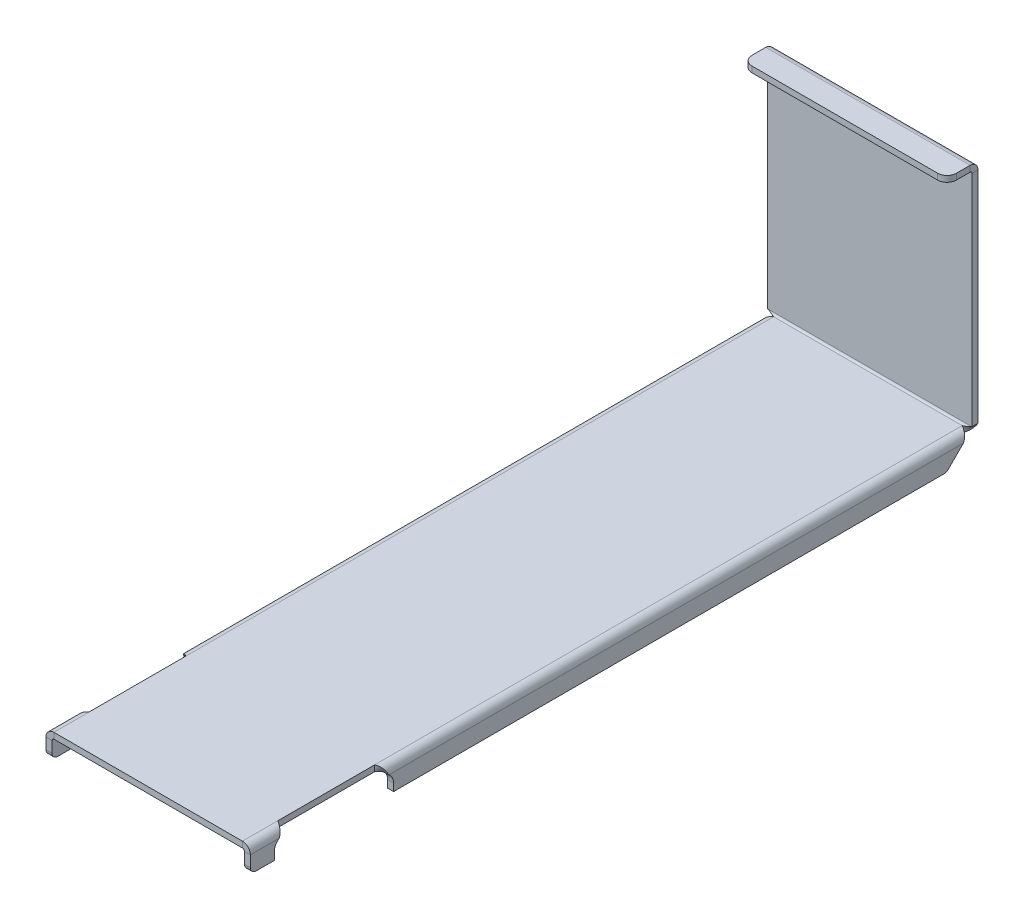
ISO-10303-21;
HEADER;
FILE_DESCRIPTION(('STEP AP214'),'2;1');
FILE_NAME('part.step','',(''),(''),'','','');
FILE_SCHEMA(('AUTOMOTIVE_DESIGN { 1 0 10303 214 1 1 1 1 }'));
ENDSEC;
DATA;
#1=APPLICATION_CONTEXT('core data for automotive mechanical design processes');
#2=APPLICATION_PROTOCOL_DEFINITION('international standard','automotive_design',2000,#1);
#3=PRODUCT_CONTEXT('',#1,'mechanical');
#4=PRODUCT('Part','Part','',(#3));
#5=PRODUCT_RELATED_PRODUCT_CATEGORY('part','',(#4));
#6=PRODUCT_DEFINITION_FORMATION('','',#4);
#7=PRODUCT_DEFINITION_CONTEXT('part definition',#1,'design');
#8=PRODUCT_DEFINITION('design','',#6,#7);
#9=PRODUCT_DEFINITION_SHAPE('','',#8);
#10=(LENGTH_UNIT() NAMED_UNIT(*) SI_UNIT(.MILLI.,.METRE.));
#11=(NAMED_UNIT(*) PLANE_ANGLE_UNIT() SI_UNIT($,.RADIAN.));
#12=(NAMED_UNIT(*) SI_UNIT($,.STERADIAN.) SOLID_ANGLE_UNIT());
#13=UNCERTAINTY_MEASURE_WITH_UNIT(LENGTH_MEASURE(1.E-05),#10,'distance_accuracy_value','');
#14=(GEOMETRIC_REPRESENTATION_CONTEXT(3) GLOBAL_UNCERTAINTY_ASSIGNED_CONTEXT((#13)) GLOBAL_UNIT_ASSIGNED_CONTEXT((#10,
#11,#12)) REPRESENTATION_CONTEXT('',''));
#15=CARTESIAN_POINT('',(0.,0.,0.));
#16=DIRECTION('',(0.,0.,1.));
#17=DIRECTION('',(1.,0.,0.));
#18=AXIS2_PLACEMENT_3D('',#15,#16,#17);
#19=CARTESIAN_POINT('',(393.980330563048,41.4827469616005,-259.582999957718));
#20=DIRECTION('',(0.,0.,1.));
#21=DIRECTION('',(1.,0.,0.));
#22=AXIS2_PLACEMENT_3D('',#19,#20,#21);
#23=PLANE('',#22);
#24=DIRECTION('',(0.,1.,0.));
#25=VECTOR('',#24,1.);
#26=CARTESIAN_POINT('',(289.205330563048,41.4827469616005,-259.582999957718));
#27=LINE('',#26,#25);
#28=CARTESIAN_POINT('',(289.205330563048,41.4827469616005,-259.582999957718));
#29=VERTEX_POINT('',#28);
#30=CARTESIAN_POINT('',(289.205330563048,154.036746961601,-259.582999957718));
#31=VERTEX_POINT('',#30);
#32=EDGE_CURVE('E1288',#29,#31,#27,.T.);
#33=ORIENTED_EDGE('',*,*,#32,.T.);
#34=DIRECTION('',(-1.,0.,0.));
#35=VECTOR('',#34,1.);
#36=CARTESIAN_POINT('',(393.980330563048,154.036746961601,-259.582999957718));
#37=LINE('',#36,#35);
#38=CARTESIAN_POINT('',(393.980330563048,154.0367469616,-259.582999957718));
#39=VERTEX_POINT('',#38);
#40=EDGE_CURVE('E1264',#39,#31,#37,.T.);
#41=ORIENTED_EDGE('',*,*,#40,.F.);
#42=DIRECTION('',(0.,1.,0.));
#43=VECTOR('',#42,1.);
#44=CARTESIAN_POINT('',(393.980330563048,41.4827469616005,-259.582999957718));
#45=LINE('',#44,#43);
#46=CARTESIAN_POINT('',(393.980330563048,41.4827469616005,-259.582999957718));
#47=VERTEX_POINT('',#46);
#48=EDGE_CURVE('E1258',#47,#39,#45,.T.);
#49=ORIENTED_EDGE('',*,*,#48,.F.);
#50=DIRECTION('',(-1.,0.,0.));
#51=VECTOR('',#50,1.);
#52=CARTESIAN_POINT('',(393.980330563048,41.4827469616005,-259.582999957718));
#53=LINE('',#52,#51);
#54=EDGE_CURVE('E841',#47,#29,#53,.T.);
#55=ORIENTED_EDGE('',*,*,#54,.T.);
#56=EDGE_LOOP('',(#33,#41,#49,#55));
#57=FACE_BOUND('',#56,.T.);
#58=ADVANCED_FACE('F157',(#57),#23,.F.);
#59=CARTESIAN_POINT('',(289.205330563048,41.4827469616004,51.0114423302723));
#60=DIRECTION('',(-1.,0.,0.));
#61=DIRECTION('',(0.,-1.,0.));
#62=AXIS2_PLACEMENT_3D('',#59,#60,#61);
#63=PLANE('',#62);
#64=ORIENTED_EDGE('',*,*,#32,.F.);
#65=CARTESIAN_POINT('',(289.205330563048,41.4827469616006,-256.504519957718));
#66=CARTESIAN_POINT('',(289.205330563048,41.4827469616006,-256.534999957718));
#67=CARTESIAN_POINT('',(289.205330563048,41.4827469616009,-259.582999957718));
#68=CARTESIAN_POINT('',(289.205330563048,41.4827469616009,-259.613784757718));
#69=B_SPLINE_CURVE_WITH_KNOTS('',1,(#65,#66,#67,#68),.UNSPECIFIED.,.F.,.F.,(2,1,1,2),(-0.0101,
-9.9999999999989E-05,0.9999,1.01),.UNSPECIFIED.);
#70=CARTESIAN_POINT('',(289.205330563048,41.4827469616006,-256.534999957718));
#71=VERTEX_POINT('',#70);
#72=EDGE_CURVE('E834',#71,#29,#69,.T.);
#73=ORIENTED_EDGE('',*,*,#72,.F.);
#74=DIRECTION('',(0.,1.,0.));
#75=VECTOR('',#74,1.);
#76=CARTESIAN_POINT('',(289.205330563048,41.4827469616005,-256.534999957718));
#77=LINE('',#76,#75);
#78=CARTESIAN_POINT('',(289.205330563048,154.0367469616,-256.534999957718));
#79=VERTEX_POINT('',#78);
#80=EDGE_CURVE('E1252',#71,#79,#77,.T.);
#81=ORIENTED_EDGE('',*,*,#80,.T.);
#82=DIRECTION('',(0.,0.,-1.));
#83=VECTOR('',#82,1.);
#84=CARTESIAN_POINT('',(289.205330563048,154.0367469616,51.0114423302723));
#85=LINE('',#84,#83);
#86=EDGE_CURVE('E1262',#79,#31,#85,.T.);
#87=ORIENTED_EDGE('',*,*,#86,.T.);
#88=EDGE_LOOP('',(#64,#73,#81,#87));
#89=FACE_BOUND('',#88,.T.);
#90=ADVANCED_FACE('F1202',(#89),#63,.T.);
#91=CARTESIAN_POINT('',(393.980330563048,41.4827469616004,51.0114423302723));
#92=DIRECTION('',(-1.,0.,0.));
#93=DIRECTION('',(0.,-1.,0.));
#94=AXIS2_PLACEMENT_3D('',#91,#92,#93);
#95=PLANE('',#94);
#96=CARTESIAN_POINT('',(393.980330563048,41.4827469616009,-259.613479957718));
#97=CARTESIAN_POINT('',(393.980330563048,41.4827469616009,-259.582999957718));
#98=CARTESIAN_POINT('',(393.980330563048,41.4827469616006,-256.534999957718));
#99=CARTESIAN_POINT('',(393.980330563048,41.4827469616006,-256.504215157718));
#100=B_SPLINE_CURVE_WITH_KNOTS('',1,(#96,#97,#98,#99),.UNSPECIFIED.,.F.,.F.,(2,1,1,2),(-0.01,0.,
1.,1.0101),.UNSPECIFIED.);
#101=CARTESIAN_POINT('',(393.980330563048,41.4827469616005,-256.534999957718));
#102=VERTEX_POINT('',#101);
#103=EDGE_CURVE('E1157',#102,#47,#100,.F.);
#104=ORIENTED_EDGE('',*,*,#103,.T.);
#105=ORIENTED_EDGE('',*,*,#48,.T.);
#106=DIRECTION('',(0.,0.,-1.));
#107=VECTOR('',#106,1.);
#108=CARTESIAN_POINT('',(393.980330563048,154.0367469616,51.0114423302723));
#109=LINE('',#108,#107);
#110=CARTESIAN_POINT('',(393.980330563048,154.0367469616,-256.534999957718));
#111=VERTEX_POINT('',#110);
#112=EDGE_CURVE('E1311',#111,#39,#109,.T.);
#113=ORIENTED_EDGE('',*,*,#112,.F.);
#114=DIRECTION('',(0.,1.,0.));
#115=VECTOR('',#114,1.);
#116=CARTESIAN_POINT('',(393.980330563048,41.4827469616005,-256.534999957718));
#117=LINE('',#116,#115);
#118=EDGE_CURVE('E1257',#102,#111,#117,.T.);
#119=ORIENTED_EDGE('',*,*,#118,.F.);
#120=EDGE_LOOP('',(#104,#105,#113,#119));
#121=FACE_BOUND('',#120,.T.);
#122=ADVANCED_FACE('F1212',(#121),#95,.F.);
#123=CARTESIAN_POINT('',(393.980330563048,41.4827469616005,-256.534999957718));
#124=DIRECTION('',(0.,0.,1.));
#125=DIRECTION('',(1.,0.,0.));
#126=AXIS2_PLACEMENT_3D('',#123,#124,#125);
#127=PLANE('',#126);
#128=ORIENTED_EDGE('',*,*,#80,.F.);
#129=DIRECTION('',(-1.,0.,0.));
#130=VECTOR('',#129,1.);
#131=CARTESIAN_POINT('',(393.980330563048,41.4827469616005,-256.534999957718));
#132=LINE('',#131,#130);
#133=EDGE_CURVE('E842',#102,#71,#132,.T.);
#134=ORIENTED_EDGE('',*,*,#133,.F.);
#135=ORIENTED_EDGE('',*,*,#118,.T.);
#136=DIRECTION('',(-1.,0.,0.));
#137=VECTOR('',#136,1.);
#138=CARTESIAN_POINT('',(393.980330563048,154.036746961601,-256.534999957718));
#139=LINE('',#138,#137);
#140=EDGE_CURVE('E1255',#111,#79,#139,.T.);
#141=ORIENTED_EDGE('',*,*,#140,.T.);
#142=EDGE_LOOP('',(#128,#134,#135,#141));
#143=FACE_BOUND('',#142,.T.);
#144=ADVANCED_FACE('F1240',(#143),#127,.T.);
#145=CARTESIAN_POINT('',(289.205330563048,154.036746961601,-255.534999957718));
#146=DIRECTION('',(1.,0.,0.));
#147=DIRECTION('',(0.,1.,0.));
#148=AXIS2_PLACEMENT_3D('',#145,#146,#147);
#149=PLANE('',#148);
#150=DIRECTION('',(0.,1.,0.));
#151=VECTOR('',#150,1.);
#152=CARTESIAN_POINT('',(289.205330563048,-55.8440587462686,-255.534999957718));
#153=LINE('',#152,#151);
#154=CARTESIAN_POINT('',(289.205330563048,155.0367469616,-255.534999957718));
#155=VERTEX_POINT('',#154);
#156=CARTESIAN_POINT('',(289.205330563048,158.0847469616,-255.534999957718));
#157=VERTEX_POINT('',#156);
#158=EDGE_CURVE('E1357',#155,#157,#153,.T.);
#159=ORIENTED_EDGE('',*,*,#158,.T.);
#160=CARTESIAN_POINT('',(289.205330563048,154.036746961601,-255.534999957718));
#161=DIRECTION('',(-1.,0.,0.));
#162=DIRECTION('',(0.,-1.,0.));
#163=AXIS2_PLACEMENT_3D('',#160,#161,#162);
#164=CIRCLE('',#163,4.048);
#165=EDGE_CURVE('E1307',#157,#31,#164,.T.);
#166=ORIENTED_EDGE('',*,*,#165,.T.);
#167=ORIENTED_EDGE('',*,*,#86,.F.);
#168=CARTESIAN_POINT('',(289.205330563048,154.036746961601,-255.534999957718));
#169=DIRECTION('',(-1.,0.,0.));
#170=DIRECTION('',(0.,-1.,0.));
#171=AXIS2_PLACEMENT_3D('',#168,#169,#170);
#172=CIRCLE('',#171,0.999999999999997);
#173=EDGE_CURVE('E1295',#155,#79,#172,.T.);
#174=ORIENTED_EDGE('',*,*,#173,.F.);
#175=EDGE_LOOP('',(#159,#166,#167,#174));
#176=FACE_BOUND('',#175,.T.);
#177=ADVANCED_FACE('F1238',(#176),#149,.F.);
#178=CARTESIAN_POINT('',(393.980330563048,154.036746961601,-255.534999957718));
#179=DIRECTION('',(-1.,0.,0.));
#180=DIRECTION('',(0.,-1.,0.));
#181=AXIS2_PLACEMENT_3D('',#178,#179,#180);
#182=PLANE('',#181);
#183=ORIENTED_EDGE('',*,*,#112,.T.);
#184=CARTESIAN_POINT('',(393.980330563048,154.036746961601,-255.534999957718));
#185=DIRECTION('',(-1.,0.,0.));
#186=DIRECTION('',(0.,-1.,0.));
#187=AXIS2_PLACEMENT_3D('',#184,#185,#186);
#188=CIRCLE('',#187,4.048);
#189=CARTESIAN_POINT('',(393.980330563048,158.0847469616,-255.534999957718));
#190=VERTEX_POINT('',#189);
#191=EDGE_CURVE('E1301',#39,#190,#188,.F.);
#192=ORIENTED_EDGE('',*,*,#191,.T.);
#193=DIRECTION('',(0.,1.,0.));
#194=VECTOR('',#193,1.);
#195=CARTESIAN_POINT('',(393.980330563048,-55.8440587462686,-255.534999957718));
#196=LINE('',#195,#194);
#197=CARTESIAN_POINT('',(393.980330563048,155.036746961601,-255.534999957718));
#198=VERTEX_POINT('',#197);
#199=EDGE_CURVE('E1323',#198,#190,#196,.T.);
#200=ORIENTED_EDGE('',*,*,#199,.F.);
#201=CARTESIAN_POINT('',(393.980330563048,154.036746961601,-255.534999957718));
#202=DIRECTION('',(1.,0.,0.));
#203=DIRECTION('',(0.,1.,0.));
#204=AXIS2_PLACEMENT_3D('',#201,#202,#203);
#205=CIRCLE('',#204,0.999999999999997);
#206=EDGE_CURVE('E1291',#111,#198,#205,.T.);
#207=ORIENTED_EDGE('',*,*,#206,.F.);
#208=EDGE_LOOP('',(#183,#192,#200,#207));
#209=FACE_BOUND('',#208,.T.);
#210=ADVANCED_FACE('F1247',(#209),#182,.F.);
#211=CARTESIAN_POINT('',(446.46852365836,154.036746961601,-255.534999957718));
#212=DIRECTION('',(-1.,0.,0.));
#213=DIRECTION('',(0.,-1.,0.));
#214=AXIS2_PLACEMENT_3D('',#211,#212,#213);
#215=CYLINDRICAL_SURFACE('',#214,0.999999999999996);
#216=ORIENTED_EDGE('',*,*,#206,.T.);
#217=DIRECTION('',(-1.,0.,0.));
#218=VECTOR('',#217,1.);
#219=CARTESIAN_POINT('',(393.980330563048,155.0367469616,-255.534999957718));
#220=LINE('',#219,#218);
#221=EDGE_CURVE('E1359',#198,#155,#220,.T.);
#222=ORIENTED_EDGE('',*,*,#221,.T.);
#223=ORIENTED_EDGE('',*,*,#173,.T.);
#224=ORIENTED_EDGE('',*,*,#140,.F.);
#225=EDGE_LOOP('',(#216,#222,#223,#224));
#226=FACE_BOUND('',#225,.T.);
#227=ADVANCED_FACE('F1437',(#226),#215,.F.);
#228=CARTESIAN_POINT('',(446.46852365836,154.036746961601,-255.534999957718));
#229=DIRECTION('',(-1.,0.,0.));
#230=DIRECTION('',(0.,-1.,0.));
#231=AXIS2_PLACEMENT_3D('',#228,#229,#230);
#232=CYLINDRICAL_SURFACE('',#231,4.048);
#233=ORIENTED_EDGE('',*,*,#191,.F.);
#234=ORIENTED_EDGE('',*,*,#40,.T.);
#235=ORIENTED_EDGE('',*,*,#165,.F.);
#236=DIRECTION('',(-1.,0.,0.));
#237=VECTOR('',#236,1.);
#238=CARTESIAN_POINT('',(393.980330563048,158.0847469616,-255.534999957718));
#239=LINE('',#238,#237);
#240=EDGE_CURVE('E1398',#190,#157,#239,.T.);
#241=ORIENTED_EDGE('',*,*,#240,.F.);
#242=EDGE_LOOP('',(#233,#234,#235,#241));
#243=FACE_BOUND('',#242,.T.);
#244=ADVANCED_FACE('F1317',(#243),#232,.T.);
#245=CARTESIAN_POINT('',(389.217830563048,-55.8440587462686,-248.470499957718));
#246=DIRECTION('',(0.,1.,0.));
#247=DIRECTION('',(0.,0.,1.));
#248=AXIS2_PLACEMENT_3D('',#245,#246,#247);
#249=CYLINDRICAL_SURFACE('',#248,4.7625);
#250=DIRECTION('',(0.,1.,0.));
#251=VECTOR('',#250,1.);
#252=CARTESIAN_POINT('',(393.980330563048,-55.8440587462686,-248.470499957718));
#253=LINE('',#252,#251);
#254=CARTESIAN_POINT('',(393.980330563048,155.0367469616,-248.470499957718));
#255=VERTEX_POINT('',#254);
#256=CARTESIAN_POINT('',(393.980330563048,158.0847469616,-248.470499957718));
#257=VERTEX_POINT('',#256);
#258=EDGE_CURVE('E1354',#255,#257,#253,.T.);
#259=ORIENTED_EDGE('',*,*,#258,.T.);
#260=CARTESIAN_POINT('',(389.217830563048,158.0847469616,-248.470499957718));
#261=DIRECTION('',(0.,-1.,0.));
#262=DIRECTION('',(0.,0.,-1.));
#263=AXIS2_PLACEMENT_3D('',#260,#261,#262);
#264=CIRCLE('',#263,4.7625);
#265=CARTESIAN_POINT('',(389.217830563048,158.0847469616,-243.707999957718));
#266=VERTEX_POINT('',#265);
#267=EDGE_CURVE('E1401',#266,#257,#264,.F.);
#268=ORIENTED_EDGE('',*,*,#267,.F.);
#269=DIRECTION('',(0.,1.,0.));
#270=VECTOR('',#269,1.);
#271=CARTESIAN_POINT('',(389.217830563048,-55.8440587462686,-243.707999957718));
#272=LINE('',#271,#270);
#273=CARTESIAN_POINT('',(389.217830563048,155.0367469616,-243.707999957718));
#274=VERTEX_POINT('',#273);
#275=EDGE_CURVE('E1348',#274,#266,#272,.T.);
#276=ORIENTED_EDGE('',*,*,#275,.F.);
#277=CARTESIAN_POINT('',(389.217830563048,155.0367469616,-248.470499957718));
#278=DIRECTION('',(0.,-1.,0.));
#279=DIRECTION('',(0.,0.,-1.));
#280=AXIS2_PLACEMENT_3D('',#277,#278,#279);
#281=CIRCLE('',#280,4.7625);
#282=EDGE_CURVE('E1328',#255,#274,#281,.T.);
#283=ORIENTED_EDGE('',*,*,#282,.F.);
#284=EDGE_LOOP('',(#259,#268,#276,#283));
#285=FACE_BOUND('',#284,.T.);
#286=ADVANCED_FACE('F1422',(#285),#249,.T.);
#287=CARTESIAN_POINT('',(293.967830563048,-55.8440587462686,-248.470499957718));
#288=DIRECTION('',(0.,1.,0.));
#289=DIRECTION('',(0.,0.,1.));
#290=AXIS2_PLACEMENT_3D('',#287,#288,#289);
#291=CYLINDRICAL_SURFACE('',#290,4.7625);
#292=DIRECTION('',(0.,1.,0.));
#293=VECTOR('',#292,1.);
#294=CARTESIAN_POINT('',(293.967830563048,-55.8440587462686,-243.707999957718));
#295=LINE('',#294,#293);
#296=CARTESIAN_POINT('',(293.967830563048,155.0367469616,-243.707999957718));
#297=VERTEX_POINT('',#296);
#298=CARTESIAN_POINT('',(293.967830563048,158.0847469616,-243.707999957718));
#299=VERTEX_POINT('',#298);
#300=EDGE_CURVE('E1351',#297,#299,#295,.T.);
#301=ORIENTED_EDGE('',*,*,#300,.T.);
#302=CARTESIAN_POINT('',(293.967830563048,158.0847469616,-248.470499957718));
#303=DIRECTION('',(0.,-1.,0.));
#304=DIRECTION('',(0.,0.,-1.));
#305=AXIS2_PLACEMENT_3D('',#302,#303,#304);
#306=CIRCLE('',#305,4.7625);
#307=CARTESIAN_POINT('',(289.205330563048,158.0847469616,-248.470499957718));
#308=VERTEX_POINT('',#307);
#309=EDGE_CURVE('E1403',#308,#299,#306,.F.);
#310=ORIENTED_EDGE('',*,*,#309,.F.);
#311=DIRECTION('',(0.,1.,0.));
#312=VECTOR('',#311,1.);
#313=CARTESIAN_POINT('',(289.205330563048,-55.8440587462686,-248.470499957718));
#314=LINE('',#313,#312);
#315=CARTESIAN_POINT('',(289.205330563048,155.0367469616,-248.470499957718));
#316=VERTEX_POINT('',#315);
#317=EDGE_CURVE('E1309',#316,#308,#314,.T.);
#318=ORIENTED_EDGE('',*,*,#317,.F.);
#319=CARTESIAN_POINT('',(293.967830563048,155.0367469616,-248.470499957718));
#320=DIRECTION('',(0.,-1.,0.));
#321=DIRECTION('',(0.,0.,-1.));
#322=AXIS2_PLACEMENT_3D('',#319,#320,#321);
#323=CIRCLE('',#322,4.7625);
#324=EDGE_CURVE('E1339',#297,#316,#323,.T.);
#325=ORIENTED_EDGE('',*,*,#324,.F.);
#326=EDGE_LOOP('',(#301,#310,#318,#325));
#327=FACE_BOUND('',#326,.T.);
#328=ADVANCED_FACE('F1411',(#327),#291,.T.);
#329=CARTESIAN_POINT('',(393.980330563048,-55.8440587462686,-243.707999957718));
#330=DIRECTION('',(0.,0.,-1.));
#331=DIRECTION('',(0.,1.,0.));
#332=AXIS2_PLACEMENT_3D('',#329,#330,#331);
#333=PLANE('',#332);
#334=ORIENTED_EDGE('',*,*,#275,.T.);
#335=DIRECTION('',(-1.,0.,0.));
#336=VECTOR('',#335,1.);
#337=CARTESIAN_POINT('',(393.980330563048,158.0847469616,-243.707999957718));
#338=LINE('',#337,#336);
#339=EDGE_CURVE('E1345',#266,#299,#338,.T.);
#340=ORIENTED_EDGE('',*,*,#339,.T.);
#341=ORIENTED_EDGE('',*,*,#300,.F.);
#342=DIRECTION('',(-1.,0.,0.));
#343=VECTOR('',#342,1.);
#344=CARTESIAN_POINT('',(393.980330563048,155.0367469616,-243.707999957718));
#345=LINE('',#344,#343);
#346=EDGE_CURVE('E1342',#274,#297,#345,.T.);
#347=ORIENTED_EDGE('',*,*,#346,.F.);
#348=EDGE_LOOP('',(#334,#340,#341,#347));
#349=FACE_BOUND('',#348,.T.);
#350=ADVANCED_FACE('F1419',(#349),#333,.F.);
#351=CARTESIAN_POINT('',(393.980330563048,155.0367469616,-255.534999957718));
#352=DIRECTION('',(0.,-1.,0.));
#353=DIRECTION('',(0.,0.,-1.));
#354=AXIS2_PLACEMENT_3D('',#351,#352,#353);
#355=PLANE('',#354);
#356=ORIENTED_EDGE('',*,*,#346,.T.);
#357=ORIENTED_EDGE('',*,*,#324,.T.);
#358=DIRECTION('',(0.,0.,-1.));
#359=VECTOR('',#358,1.);
#360=CARTESIAN_POINT('',(289.205330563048,155.0367469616,-255.534999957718));
#361=LINE('',#360,#359);
#362=EDGE_CURVE('E1396',#155,#316,#361,.F.);
#363=ORIENTED_EDGE('',*,*,#362,.F.);
#364=ORIENTED_EDGE('',*,*,#221,.F.);
#365=DIRECTION('',(0.,0.,-1.));
#366=VECTOR('',#365,1.);
#367=CARTESIAN_POINT('',(393.980330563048,155.0367469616,-255.534999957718));
#368=LINE('',#367,#366);
#369=EDGE_CURVE('E1333',#198,#255,#368,.F.);
#370=ORIENTED_EDGE('',*,*,#369,.T.);
#371=ORIENTED_EDGE('',*,*,#282,.T.);
#372=EDGE_LOOP('',(#356,#357,#363,#364,#370,#371));
#373=FACE_BOUND('',#372,.T.);
#374=ADVANCED_FACE('F1416',(#373),#355,.T.);
#375=CARTESIAN_POINT('',(393.980330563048,-55.8440587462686,-255.534999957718));
#376=DIRECTION('',(-1.,0.,0.));
#377=DIRECTION('',(0.,0.,-1.));
#378=AXIS2_PLACEMENT_3D('',#375,#376,#377);
#379=PLANE('',#378);
#380=ORIENTED_EDGE('',*,*,#199,.T.);
#381=DIRECTION('',(0.,0.,1.));
#382=VECTOR('',#381,1.);
#383=CARTESIAN_POINT('',(393.980330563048,158.0847469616,-255.534999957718));
#384=LINE('',#383,#382);
#385=EDGE_CURVE('E1327',#190,#257,#384,.T.);
#386=ORIENTED_EDGE('',*,*,#385,.T.);
#387=ORIENTED_EDGE('',*,*,#258,.F.);
#388=ORIENTED_EDGE('',*,*,#369,.F.);
#389=EDGE_LOOP('',(#380,#386,#387,#388));
#390=FACE_BOUND('',#389,.T.);
#391=ADVANCED_FACE('F1424',(#390),#379,.F.);
#392=CARTESIAN_POINT('',(393.980330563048,158.0847469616,-255.534999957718));
#393=DIRECTION('',(0.,-1.,0.));
#394=DIRECTION('',(0.,0.,-1.));
#395=AXIS2_PLACEMENT_3D('',#392,#393,#394);
#396=PLANE('',#395);
#397=DIRECTION('',(0.,0.,1.));
#398=VECTOR('',#397,1.);
#399=CARTESIAN_POINT('',(289.205330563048,158.0847469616,-255.534999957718));
#400=LINE('',#399,#398);
#401=EDGE_CURVE('E1330',#157,#308,#400,.T.);
#402=ORIENTED_EDGE('',*,*,#401,.T.);
#403=ORIENTED_EDGE('',*,*,#309,.T.);
#404=ORIENTED_EDGE('',*,*,#339,.F.);
#405=ORIENTED_EDGE('',*,*,#267,.T.);
#406=ORIENTED_EDGE('',*,*,#385,.F.);
#407=ORIENTED_EDGE('',*,*,#240,.T.);
#408=EDGE_LOOP('',(#402,#403,#404,#405,#406,#407));
#409=FACE_BOUND('',#408,.T.);
#410=ADVANCED_FACE('F1406',(#409),#396,.F.);
#411=CARTESIAN_POINT('',(289.205330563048,-55.8440587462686,-255.534999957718));
#412=DIRECTION('',(-1.,0.,0.));
#413=DIRECTION('',(0.,0.,-1.));
#414=AXIS2_PLACEMENT_3D('',#411,#412,#413);
#415=PLANE('',#414);
#416=ORIENTED_EDGE('',*,*,#401,.F.);
#417=ORIENTED_EDGE('',*,*,#158,.F.);
#418=ORIENTED_EDGE('',*,*,#362,.T.);
#419=ORIENTED_EDGE('',*,*,#317,.T.);
#420=EDGE_LOOP('',(#416,#417,#418,#419));
#421=FACE_BOUND('',#420,.T.);
#422=ADVANCED_FACE('F1413',(#421),#415,.T.);
#423=CARTESIAN_POINT('',(389.932330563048,37.4347469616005,70.6170000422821));
#424=DIRECTION('',(-1.,0.,0.));
#425=DIRECTION('',(0.,0.,1.));
#426=AXIS2_PLACEMENT_3D('',#423,#424,#425);
#427=PLANE('',#426);
#428=DIRECTION('',(0.,0.,1.));
#429=VECTOR('',#428,1.);
#430=CARTESIAN_POINT('',(389.932330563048,37.4347469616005,113.479500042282));
#431=LINE('',#430,#429);
#432=CARTESIAN_POINT('',(389.932330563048,37.4347469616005,95.4138750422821));
#433=VERTEX_POINT('',#432);
#434=CARTESIAN_POINT('',(389.932330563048,37.4347469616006,45.8201250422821));
#435=VERTEX_POINT('',#434);
#436=EDGE_CURVE('E1387',#433,#435,#431,.F.);
#437=ORIENTED_EDGE('',*,*,#436,.T.);
#438=CARTESIAN_POINT('',(389.932330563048,40.4827469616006,45.8201250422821));
#439=CARTESIAN_POINT('',(389.932330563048,37.4347469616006,45.8201250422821));
#440=B_SPLINE_CURVE_WITH_KNOTS('',1,(#438,#439),.UNSPECIFIED.,.F.,.F.,(2,2),(0.,1.),.UNSPECIFIED.);
#441=CARTESIAN_POINT('',(389.932330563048,40.4827469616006,45.8201250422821));
#442=VERTEX_POINT('',#441);
#443=EDGE_CURVE('E1066',#435,#442,#440,.F.);
#444=ORIENTED_EDGE('',*,*,#443,.T.);
#445=DIRECTION('',(0.,0.,1.));
#446=VECTOR('',#445,1.);
#447=CARTESIAN_POINT('',(389.932330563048,40.4827469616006,113.479500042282));
#448=LINE('',#447,#446);
#449=CARTESIAN_POINT('',(389.932330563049,40.4827469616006,95.4138750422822));
#450=VERTEX_POINT('',#449);
#451=EDGE_CURVE('E1360',#450,#442,#448,.F.);
#452=ORIENTED_EDGE('',*,*,#451,.F.);
#453=CARTESIAN_POINT('',(389.932330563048,37.4347469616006,95.4138750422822));
#454=CARTESIAN_POINT('',(389.932330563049,40.4827469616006,95.4138750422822));
#455=B_SPLINE_CURVE_WITH_KNOTS('',1,(#453,#454),.UNSPECIFIED.,.F.,.F.,(2,2),(0.,1.),.UNSPECIFIED.);
#456=EDGE_CURVE('E1185',#433,#450,#455,.T.);
#457=ORIENTED_EDGE('',*,*,#456,.F.);
#458=EDGE_LOOP('',(#437,#444,#452,#457));
#459=FACE_BOUND('',#458,.T.);
#460=ADVANCED_FACE('F805',(#459),#427,.F.);
#461=CARTESIAN_POINT('',(390.932330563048,807.684159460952,113.479500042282));
#462=DIRECTION('',(0.,0.,-1.));
#463=DIRECTION('',(-1.,0.,0.));
#464=AXIS2_PLACEMENT_3D('',#461,#462,#463);
#465=PLANE('',#464);
#466=DIRECTION('',(0.,1.,0.));
#467=VECTOR('',#466,1.);
#468=CARTESIAN_POINT('',(293.253330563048,37.4347469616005,113.479500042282));
#469=LINE('',#468,#467);
#470=CARTESIAN_POINT('',(293.253330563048,37.4347469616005,113.479500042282));
#471=VERTEX_POINT('',#470);
#472=CARTESIAN_POINT('',(293.253330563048,40.4827469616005,113.479500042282));
#473=VERTEX_POINT('',#472);
#474=EDGE_CURVE('E768',#471,#473,#469,.T.);
#475=ORIENTED_EDGE('',*,*,#474,.F.);
#476=DIRECTION('',(-1.,0.,0.));
#477=VECTOR('',#476,1.);
#478=CARTESIAN_POINT('',(393.980330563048,37.4347469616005,113.479500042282));
#479=LINE('',#478,#477);
#480=CARTESIAN_POINT('',(389.932330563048,37.4347469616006,113.479500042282));
#481=VERTEX_POINT('',#480);
#482=EDGE_CURVE('E1383',#481,#471,#479,.T.);
#483=ORIENTED_EDGE('',*,*,#482,.F.);
#484=DIRECTION('',(0.,1.,0.));
#485=VECTOR('',#484,1.);
#486=CARTESIAN_POINT('',(389.932330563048,37.4347469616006,113.479500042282));
#487=LINE('',#486,#485);
#488=CARTESIAN_POINT('',(389.932330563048,40.4827469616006,113.479500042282));
#489=VERTEX_POINT('',#488);
#490=EDGE_CURVE('E1190',#481,#489,#487,.T.);
#491=ORIENTED_EDGE('',*,*,#490,.T.);
#492=DIRECTION('',(1.,0.,0.));
#493=VECTOR('',#492,1.);
#494=CARTESIAN_POINT('',(390.932330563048,40.4827469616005,113.479500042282));
#495=LINE('',#494,#493);
#496=EDGE_CURVE('E1361',#473,#489,#495,.T.);
#497=ORIENTED_EDGE('',*,*,#496,.F.);
#498=EDGE_LOOP('',(#475,#483,#491,#497));
#499=FACE_BOUND('',#498,.T.);
#500=ADVANCED_FACE('F1501',(#499),#465,.F.);
#501=CARTESIAN_POINT('',(393.980330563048,37.4347469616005,113.479500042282));
#502=DIRECTION('',(0.,1.,0.));
#503=DIRECTION('',(0.,0.,1.));
#504=AXIS2_PLACEMENT_3D('',#501,#502,#503);
#505=PLANE('',#504);
#506=DIRECTION('',(0.,0.,1.));
#507=VECTOR('',#506,1.);
#508=CARTESIAN_POINT('',(293.253330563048,37.4347469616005,-255.534999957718));
#509=LINE('',#508,#507);
#510=CARTESIAN_POINT('',(293.253330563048,37.4347469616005,-255.534999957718));
#511=VERTEX_POINT('',#510);
#512=CARTESIAN_POINT('',(293.253330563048,37.4347469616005,45.8201250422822));
#513=VERTEX_POINT('',#512);
#514=EDGE_CURVE('E757',#511,#513,#509,.T.);
#515=ORIENTED_EDGE('',*,*,#514,.F.);
#516=DIRECTION('',(-1.,0.,0.));
#517=VECTOR('',#516,1.);
#518=CARTESIAN_POINT('',(393.980330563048,37.4347469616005,-255.534999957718));
#519=LINE('',#518,#517);
#520=CARTESIAN_POINT('',(389.932330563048,37.4347469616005,-255.534999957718));
#521=VERTEX_POINT('',#520);
#522=EDGE_CURVE('E778',#521,#511,#519,.T.);
#523=ORIENTED_EDGE('',*,*,#522,.F.);
#524=DIRECTION('',(0.,0.,-1.));
#525=VECTOR('',#524,1.);
#526=CARTESIAN_POINT('',(389.932330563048,37.4347469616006,113.479500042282));
#527=LINE('',#526,#525);
#528=EDGE_CURVE('E1177',#435,#521,#527,.T.);
#529=ORIENTED_EDGE('',*,*,#528,.F.);
#530=ORIENTED_EDGE('',*,*,#436,.F.);
#531=DIRECTION('',(0.,0.,-1.));
#532=VECTOR('',#531,1.);
#533=CARTESIAN_POINT('',(389.932330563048,37.4347469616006,113.479500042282));
#534=LINE('',#533,#532);
#535=EDGE_CURVE('E1188',#481,#433,#534,.T.);
#536=ORIENTED_EDGE('',*,*,#535,.F.);
#537=ORIENTED_EDGE('',*,*,#482,.T.);
#538=DIRECTION('',(0.,0.,1.));
#539=VECTOR('',#538,1.);
#540=CARTESIAN_POINT('',(293.253330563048,37.4347469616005,-255.534999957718));
#541=LINE('',#540,#539);
#542=CARTESIAN_POINT('',(293.253330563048,37.4347469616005,95.4138750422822));
#543=VERTEX_POINT('',#542);
#544=EDGE_CURVE('E766',#543,#471,#541,.T.);
#545=ORIENTED_EDGE('',*,*,#544,.F.);
#546=DIRECTION('',(0.,0.,-1.));
#547=VECTOR('',#546,1.);
#548=CARTESIAN_POINT('',(293.253330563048,37.4347469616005,-255.534999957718));
#549=LINE('',#548,#547);
#550=EDGE_CURVE('E1379',#513,#543,#549,.F.);
#551=ORIENTED_EDGE('',*,*,#550,.F.);
#552=EDGE_LOOP('',(#515,#523,#529,#530,#536,#537,#545,#551));
#553=FACE_BOUND('',#552,.T.);
#554=ADVANCED_FACE('F1512',(#553),#505,.F.);
#555=CARTESIAN_POINT('',(293.253330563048,37.4347469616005,70.6170000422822));
#556=DIRECTION('',(1.,0.,0.));
#557=DIRECTION('',(0.,0.,-1.));
#558=AXIS2_PLACEMENT_3D('',#555,#556,#557);
#559=PLANE('',#558);
#560=ORIENTED_EDGE('',*,*,#550,.T.);
#561=CARTESIAN_POINT('',(293.253330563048,40.4827469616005,95.4138750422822));
#562=CARTESIAN_POINT('',(293.253330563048,37.4347469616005,95.4138750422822));
#563=B_SPLINE_CURVE_WITH_KNOTS('',1,(#561,#562),.UNSPECIFIED.,.F.,.F.,(2,2),(0.,1.),.UNSPECIFIED.);
#564=CARTESIAN_POINT('',(293.253330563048,40.4827469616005,95.4138750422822));
#565=VERTEX_POINT('',#564);
#566=EDGE_CURVE('E588',#543,#565,#563,.F.);
#567=ORIENTED_EDGE('',*,*,#566,.T.);
#568=DIRECTION('',(0.,0.,-1.));
#569=VECTOR('',#568,1.);
#570=CARTESIAN_POINT('',(293.253330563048,40.4827469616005,-255.534999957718));
#571=LINE('',#570,#569);
#572=CARTESIAN_POINT('',(293.253330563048,40.4827469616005,45.8201250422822));
#573=VERTEX_POINT('',#572);
#574=EDGE_CURVE('E1364',#573,#565,#571,.F.);
#575=ORIENTED_EDGE('',*,*,#574,.F.);
#576=CARTESIAN_POINT('',(293.253330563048,37.4347469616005,45.8201250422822));
#577=CARTESIAN_POINT('',(293.253330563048,40.4827469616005,45.8201250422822));
#578=B_SPLINE_CURVE_WITH_KNOTS('',1,(#576,#577),.UNSPECIFIED.,.F.,.F.,(2,2),(0.,1.),.UNSPECIFIED.);
#579=EDGE_CURVE('E759',#513,#573,#578,.T.);
#580=ORIENTED_EDGE('',*,*,#579,.F.);
#581=EDGE_LOOP('',(#560,#567,#575,#580));
#582=FACE_BOUND('',#581,.T.);
#583=ADVANCED_FACE('F1520',(#582),#559,.F.);
#584=CARTESIAN_POINT('',(390.932330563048,40.4827469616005,113.479500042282));
#585=DIRECTION('',(0.,1.,0.));
#586=DIRECTION('',(0.,0.,1.));
#587=AXIS2_PLACEMENT_3D('',#584,#585,#586);
#588=PLANE('',#587);
#589=DIRECTION('',(-1.,0.,0.));
#590=VECTOR('',#589,1.);
#591=CARTESIAN_POINT('',(393.980330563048,40.4827469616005,-255.534999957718));
#592=LINE('',#591,#590);
#593=CARTESIAN_POINT('',(389.932330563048,40.4827469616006,-255.534999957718));
#594=VERTEX_POINT('',#593);
#595=CARTESIAN_POINT('',(293.253330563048,40.4827469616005,-255.534999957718));
#596=VERTEX_POINT('',#595);
#597=EDGE_CURVE('E1375',#594,#596,#592,.T.);
#598=ORIENTED_EDGE('',*,*,#597,.T.);
#599=DIRECTION('',(0.,0.,1.));
#600=VECTOR('',#599,1.);
#601=CARTESIAN_POINT('',(293.253330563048,40.4827469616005,-255.534999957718));
#602=LINE('',#601,#600);
#603=EDGE_CURVE('E746',#596,#573,#602,.T.);
#604=ORIENTED_EDGE('',*,*,#603,.T.);
#605=ORIENTED_EDGE('',*,*,#574,.T.);
#606=DIRECTION('',(0.,0.,1.));
#607=VECTOR('',#606,1.);
#608=CARTESIAN_POINT('',(293.253330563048,40.4827469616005,-255.534999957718));
#609=LINE('',#608,#607);
#610=EDGE_CURVE('E762',#565,#473,#609,.T.);
#611=ORIENTED_EDGE('',*,*,#610,.T.);
#612=ORIENTED_EDGE('',*,*,#496,.T.);
#613=DIRECTION('',(0.,0.,-1.));
#614=VECTOR('',#613,1.);
#615=CARTESIAN_POINT('',(389.932330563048,40.4827469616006,113.479500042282));
#616=LINE('',#615,#614);
#617=EDGE_CURVE('E1193',#489,#450,#616,.T.);
#618=ORIENTED_EDGE('',*,*,#617,.T.);
#619=ORIENTED_EDGE('',*,*,#451,.T.);
#620=DIRECTION('',(0.,0.,-1.));
#621=VECTOR('',#620,1.);
#622=CARTESIAN_POINT('',(389.932330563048,40.4827469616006,113.479500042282));
#623=LINE('',#622,#621);
#624=EDGE_CURVE('E1180',#442,#594,#623,.T.);
#625=ORIENTED_EDGE('',*,*,#624,.T.);
#626=EDGE_LOOP('',(#598,#604,#605,#611,#612,#618,#619,#625));
#627=FACE_BOUND('',#626,.T.);
#628=ADVANCED_FACE('F1531',(#627),#588,.T.);
#629=CARTESIAN_POINT('',(389.932330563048,37.4042669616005,-255.534999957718));
#630=CARTESIAN_POINT('',(390.269707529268,37.4042669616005,-256.068940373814));
#631=CARTESIAN_POINT('',(390.606997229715,37.5104188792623,-256.60253346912));
#632=CARTESIAN_POINT('',(391.281663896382,37.9190266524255,-257.588999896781));
#633=CARTESIAN_POINT('',(391.618997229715,38.2213217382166,-258.041416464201));
#634=CARTESIAN_POINT('',(392.293663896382,38.9763304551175,-258.796425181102));
#635=CARTESIAN_POINT('',(392.630997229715,39.4287470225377,-259.098720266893));
#636=CARTESIAN_POINT('',(393.305663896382,40.4152134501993,-259.507328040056));
#637=CARTESIAN_POINT('',(393.642953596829,40.9488065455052,-259.613479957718));
#638=CARTESIAN_POINT('',(393.980330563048,41.4827469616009,-259.613479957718));
#639=CARTESIAN_POINT('',(389.932330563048,37.4347469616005,-255.534999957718));
#640=CARTESIAN_POINT('',(390.269707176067,37.4347469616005,-256.064949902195));
#641=CARTESIAN_POINT('',(390.606997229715,37.5401055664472,-256.594555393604));
#642=CARTESIAN_POINT('',(391.281663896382,37.9456596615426,-257.573649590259));
#643=CARTESIAN_POINT('',(391.618997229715,38.2456955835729,-258.022685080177));
#644=CARTESIAN_POINT('',(392.293663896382,38.9950618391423,-258.772051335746));
#645=CARTESIAN_POINT('',(392.630997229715,39.4440973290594,-259.072087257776));
#646=CARTESIAN_POINT('',(393.305663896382,40.4231915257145,-259.477641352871));
#647=CARTESIAN_POINT('',(393.642953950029,40.9527970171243,-259.582999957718));
#648=CARTESIAN_POINT('',(393.980330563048,41.4827469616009,-259.582999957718));
#649=CARTESIAN_POINT('',(389.932330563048,40.4827469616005,-255.534999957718));
#650=CARTESIAN_POINT('',(390.269671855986,40.4827469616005,-255.665902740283));
#651=CARTESIAN_POINT('',(390.606997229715,40.5087742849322,-255.796747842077));
#652=CARTESIAN_POINT('',(391.281663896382,40.6089605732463,-256.038618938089));
#653=CARTESIAN_POINT('',(391.618997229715,40.6830801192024,-256.149546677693));
#654=CARTESIAN_POINT('',(392.293663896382,40.8682002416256,-256.334666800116));
#655=CARTESIAN_POINT('',(392.630997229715,40.9791279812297,-256.408786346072));
#656=CARTESIAN_POINT('',(393.305663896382,41.2209990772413,-256.508972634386));
#657=CARTESIAN_POINT('',(393.642989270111,41.3518441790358,-256.534999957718));
#658=CARTESIAN_POINT('',(393.980330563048,41.4827469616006,-256.534999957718));
#659=CARTESIAN_POINT('',(389.932330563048,40.5135317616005,-255.534999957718));
#660=CARTESIAN_POINT('',(390.269671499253,40.5135317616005,-255.661872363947));
#661=CARTESIAN_POINT('',(390.606997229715,40.5387578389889,-255.788689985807));
#662=CARTESIAN_POINT('',(391.281663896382,40.6358599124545,-256.023115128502));
#663=CARTESIAN_POINT('',(391.618997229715,40.7076977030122,-256.130627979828));
#664=CARTESIAN_POINT('',(392.293663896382,40.8871189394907,-256.310049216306));
#665=CARTESIAN_POINT('',(392.630997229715,40.9946317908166,-256.381887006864));
#666=CARTESIAN_POINT('',(393.305663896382,41.2290569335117,-256.478989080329));
#667=CARTESIAN_POINT('',(393.642989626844,41.3558745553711,-256.504215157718));
#668=CARTESIAN_POINT('',(393.980330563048,41.4827469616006,-256.504215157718));
#669=B_SPLINE_SURFACE_WITH_KNOTS('',1,3,((#629,#630,#631,#632,#633,#634,#635,#636,#637,#638),
(#639,#640,#641,#642,#643,#644,#645,#646,#647,#648),(#649,#650,#651,#652,#653,#654,#655,#656,
#657,#658),(#659,#660,#661,#662,#663,#664,#665,#666,#667,#668)),.UNSPECIFIED.,.F.,.F.,.F.,(2,1,
1,2),(4,2,2,2,4),(-0.01,0.,1.,1.0101),(0.,0.25,0.5,0.75,1.),.UNSPECIFIED.);
#670=CARTESIAN_POINT('',(389.932330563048,40.5135317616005,-255.534999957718));
#671=CARTESIAN_POINT('',(389.932330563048,40.4827469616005,-255.534999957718));
#672=CARTESIAN_POINT('',(389.932330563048,37.4347469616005,-255.534999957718));
#673=CARTESIAN_POINT('',(389.932330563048,37.4042669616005,-255.534999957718));
#674=B_SPLINE_CURVE_WITH_KNOTS('',1,(#670,#671,#672,#673),.UNSPECIFIED.,.F.,.F.,(2,1,1,2),
(-0.01,9.9999999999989E-05,1.0001,1.0101),.UNSPECIFIED.);
#675=EDGE_CURVE('E754',#594,#521,#674,.T.);
#676=CARTESIAN_POINT('',(389.932330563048,37.4347469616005,-255.534999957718));
#677=CARTESIAN_POINT('',(390.018325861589,37.4347225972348,-255.670073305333));
#678=CARTESIAN_POINT('',(390.104317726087,37.4415065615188,-255.80514470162));
#679=CARTESIAN_POINT('',(390.276292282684,37.4685163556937,-256.07393053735));
#680=CARTESIAN_POINT('',(390.362274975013,37.4887412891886,-256.20764506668));
#681=CARTESIAN_POINT('',(390.534184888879,37.5424409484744,-256.472297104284));
#682=CARTESIAN_POINT('',(390.620112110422,37.5759071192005,-256.603236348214));
#683=CARTESIAN_POINT('',(390.79196963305,37.6557452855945,-256.861113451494));
#684=CARTESIAN_POINT('',(390.877899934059,37.7021170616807,-256.988051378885));
#685=CARTESIAN_POINT('',(391.049851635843,37.8073608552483,-257.236792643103));
#686=CARTESIAN_POINT('',(391.135873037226,37.8662459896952,-257.358590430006));
#687=CARTESIAN_POINT('',(391.307910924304,37.9959002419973,-257.595694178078));
#688=CARTESIAN_POINT('',(391.393927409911,38.0666695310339,-257.711000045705));
#689=CARTESIAN_POINT('',(391.565919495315,38.219342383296,-257.933902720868));
#690=CARTESIAN_POINT('',(391.651895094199,38.3012403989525,-258.041503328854));
#691=CARTESIAN_POINT('',(391.823849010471,38.4753755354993,-258.247979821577));
#692=CARTESIAN_POINT('',(391.909827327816,38.5676125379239,-258.346855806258));
#693=CARTESIAN_POINT('',(392.081770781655,38.7614886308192,-258.534881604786));
#694=CARTESIAN_POINT('',(392.167735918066,38.8631262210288,-258.624032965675));
#695=CARTESIAN_POINT('',(392.339697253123,39.0748494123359,-258.791774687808));
#696=CARTESIAN_POINT('',(392.425693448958,39.1849386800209,-258.87036042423));
#697=CARTESIAN_POINT('',(392.597724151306,39.4124655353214,-259.016164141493));
#698=CARTESIAN_POINT('',(392.683758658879,39.529906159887,-259.083377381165));
#699=CARTESIAN_POINT('',(392.855791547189,39.7708632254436,-259.205695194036));
#700=CARTESIAN_POINT('',(392.941789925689,39.8943767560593,-259.260805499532));
#701=CARTESIAN_POINT('',(393.107171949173,40.136603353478,-259.354653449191));
#702=CARTESIAN_POINT('',(393.186556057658,40.2549559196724,-259.394323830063));
#703=CARTESIAN_POINT('',(393.34531593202,40.4948161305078,-259.462574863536));
#704=CARTESIAN_POINT('',(393.424691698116,40.6163236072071,-259.491156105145));
#705=CARTESIAN_POINT('',(393.583438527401,40.8614465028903,-259.536977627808));
#706=CARTESIAN_POINT('',(393.662809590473,40.9850617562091,-259.554218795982));
#707=CARTESIAN_POINT('',(393.821563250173,41.2333663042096,-259.577239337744));
#708=CARTESIAN_POINT('',(393.900945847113,41.3580557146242,-259.583017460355));
#709=CARTESIAN_POINT('',(393.980330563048,41.4827469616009,-259.582999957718));
#710=B_SPLINE_CURVE_WITH_KNOTS('',3,(#676,#677,#678,#679,#680,#681,#682,#683,#684,#685,#686,
#687,#688,#689,#690,#691,#692,#693,#694,#695,#696,#697,#698,#699,#700,#701,#702,#703,#704,#705,
#706,#707,#708,#709),.UNSPECIFIED.,.F.,.F.,(4,2,2,2,2,2,2,2,2,2,2,2,2,2,2,2,4),(0.,
0.480226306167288,0.960420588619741,1.4403051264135,1.92018149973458,2.40056340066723,
2.88095222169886,3.36110244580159,3.84124716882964,4.32131539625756,4.80159308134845,
5.28207050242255,5.76231986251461,6.20566358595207,6.64898375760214,7.09226924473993,
7.53560310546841),.UNSPECIFIED.);
#711=EDGE_CURVE('E851',#521,#47,#710,.T.);
#712=CARTESIAN_POINT('',(389.932330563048,40.4827469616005,-255.534999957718));
#713=CARTESIAN_POINT('',(390.011043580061,40.4827442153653,-255.565541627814));
#714=CARTESIAN_POINT('',(390.089749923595,40.4841466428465,-255.596082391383));
#715=CARTESIAN_POINT('',(390.247161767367,40.4897363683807,-255.65690925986));
#716=CARTESIAN_POINT('',(390.325867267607,40.4939236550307,-255.68719536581));
#717=CARTESIAN_POINT('',(390.561994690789,40.5106240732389,-255.777289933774));
#718=CARTESIAN_POINT('',(390.719435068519,40.5272757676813,-255.836337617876));
#719=CARTESIAN_POINT('',(391.033801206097,40.5709893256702,-255.950221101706));
#720=CARTESIAN_POINT('',(391.190727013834,40.5980179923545,-256.005069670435));
#721=CARTESIAN_POINT('',(391.504549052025,40.6615887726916,-256.108936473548));
#722=CARTESIAN_POINT('',(391.661445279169,40.6981283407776,-256.157956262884));
#723=CARTESIAN_POINT('',(391.907425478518,40.7619090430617,-256.228967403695));
#724=CARTESIAN_POINT('',(391.996522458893,40.7863475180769,-256.2534864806));
#725=CARTESIAN_POINT('',(392.174708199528,40.8376285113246,-256.299864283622));
#726=CARTESIAN_POINT('',(392.263796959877,40.8644708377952,-256.321723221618));
#727=CARTESIAN_POINT('',(392.531002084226,40.9481637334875,-256.382933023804));
#728=CARTESIAN_POINT('',(392.709141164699,41.0082024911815,-256.417941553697));
#729=CARTESIAN_POINT('',(393.069374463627,41.1355988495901,-256.475468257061));
#730=CARTESIAN_POINT('',(393.25146880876,41.2030892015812,-256.497692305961));
#731=CARTESIAN_POINT('',(393.524666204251,41.3067247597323,-256.520022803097));
#732=CARTESIAN_POINT('',(393.615795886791,41.3416916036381,-256.525632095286));
#733=CARTESIAN_POINT('',(393.798057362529,41.4120209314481,-256.533123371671));
#734=CARTESIAN_POINT('',(393.889189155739,41.4473834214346,-256.53500529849));
#735=CARTESIAN_POINT('',(393.980330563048,41.4827469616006,-256.534999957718));
#736=B_SPLINE_CURVE_WITH_KNOTS('',3,(#712,#713,#714,#715,#716,#717,#718,#719,#720,#721,#722,
#723,#724,#725,#726,#727,#728,#729,#730,#731,#732,#733,#734,#735),.UNSPECIFIED.,.F.,.F.,(4,2,2,
2,2,2,2,2,2,2,2,4),(0.,0.253267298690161,0.506533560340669,1.01304183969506,1.517943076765,
2.02270931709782,2.30940697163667,2.5960817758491,3.16916142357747,3.75494650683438,
4.0481903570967,4.34143872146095),.UNSPECIFIED.);
#737=EDGE_CURVE('E779',#594,#102,#736,.T.);
#738=ORIENTED_EDGE('',*,*,#675,.T.);
#739=ORIENTED_EDGE('',*,*,#711,.T.);
#740=ORIENTED_EDGE('',*,*,#103,.F.);
#741=ORIENTED_EDGE('',*,*,#737,.F.);
#742=EDGE_LOOP('',(#738,#739,#740,#741));
#743=FACE_BOUND('',#742,.T.);
#744=ADVANCED_FACE('F800',(#743),#669,.F.);
#745=CARTESIAN_POINT('',(289.205330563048,41.4827469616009,-259.613784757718));
#746=CARTESIAN_POINT('',(289.5427075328,40.948766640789,-259.613784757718));
#747=CARTESIAN_POINT('',(289.879997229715,40.4151336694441,-259.507624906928));
#748=CARTESIAN_POINT('',(290.554663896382,39.4285935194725,-259.098986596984));
#749=CARTESIAN_POINT('',(290.891997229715,38.9761431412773,-258.796668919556));
#750=CARTESIAN_POINT('',(291.566663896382,38.221077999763,-258.041603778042));
#751=CARTESIAN_POINT('',(291.903997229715,37.9187603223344,-257.589153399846));
#752=CARTESIAN_POINT('',(292.578663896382,37.5101220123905,-256.602613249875));
#753=CARTESIAN_POINT('',(292.915953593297,37.4039621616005,-256.06898027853));
#754=CARTESIAN_POINT('',(293.253330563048,37.4039621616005,-255.534999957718));
#755=CARTESIAN_POINT('',(289.205330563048,41.4827469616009,-259.582999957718));
#756=CARTESIAN_POINT('',(289.542707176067,40.9527970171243,-259.582999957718));
#757=CARTESIAN_POINT('',(289.879997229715,40.4231915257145,-259.477641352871));
#758=CARTESIAN_POINT('',(290.554663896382,39.4440973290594,-259.072087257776));
#759=CARTESIAN_POINT('',(290.891997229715,38.9950618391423,-258.772051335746));
#760=CARTESIAN_POINT('',(291.566663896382,38.2456955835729,-258.022685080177));
#761=CARTESIAN_POINT('',(291.903997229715,37.9456596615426,-257.573649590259));
#762=CARTESIAN_POINT('',(292.578663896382,37.5401055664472,-256.594555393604));
#763=CARTESIAN_POINT('',(292.915953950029,37.4347469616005,-256.064949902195));
#764=CARTESIAN_POINT('',(293.253330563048,37.4347469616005,-255.534999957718));
#765=CARTESIAN_POINT('',(289.205330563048,41.4827469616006,-256.534999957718));
#766=CARTESIAN_POINT('',(289.542671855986,41.3518441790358,-256.534999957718));
#767=CARTESIAN_POINT('',(289.879997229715,41.2209990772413,-256.508972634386));
#768=CARTESIAN_POINT('',(290.554663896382,40.9791279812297,-256.408786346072));
#769=CARTESIAN_POINT('',(290.891997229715,40.8682002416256,-256.334666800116));
#770=CARTESIAN_POINT('',(291.566663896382,40.6830801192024,-256.149546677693));
#771=CARTESIAN_POINT('',(291.903997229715,40.6089605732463,-256.038618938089));
#772=CARTESIAN_POINT('',(292.578663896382,40.5087742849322,-255.796747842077));
#773=CARTESIAN_POINT('',(292.915989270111,40.4827469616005,-255.665902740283));
#774=CARTESIAN_POINT('',(293.253330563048,40.4827469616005,-255.534999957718));
#775=CARTESIAN_POINT('',(289.205330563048,41.4827469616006,-256.504519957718));
#776=CARTESIAN_POINT('',(289.542671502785,41.3558346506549,-256.504519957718));
#777=CARTESIAN_POINT('',(289.879997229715,41.2289771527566,-256.479285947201));
#778=CARTESIAN_POINT('',(290.554663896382,40.9944782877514,-256.382153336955));
#779=CARTESIAN_POINT('',(290.891997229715,40.8869316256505,-256.31029295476));
#780=CARTESIAN_POINT('',(291.566663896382,40.7074539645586,-256.130815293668));
#781=CARTESIAN_POINT('',(291.903997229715,40.6355935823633,-256.023268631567));
#782=CARTESIAN_POINT('',(292.578663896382,40.538460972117,-255.788769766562));
#783=CARTESIAN_POINT('',(292.915989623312,40.5132269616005,-255.661912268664));
#784=CARTESIAN_POINT('',(293.253330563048,40.5132269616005,-255.534999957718));
#785=B_SPLINE_SURFACE_WITH_KNOTS('',1,3,((#745,#746,#747,#748,#749,#750,#751,#752,#753,#754),
(#755,#756,#757,#758,#759,#760,#761,#762,#763,#764),(#765,#766,#767,#768,#769,#770,#771,#772,
#773,#774),(#775,#776,#777,#778,#779,#780,#781,#782,#783,#784)),.UNSPECIFIED.,.F.,.F.,.F.,(2,1,
1,2),(4,2,2,2,4),(-0.0101,0.,1.,1.01),(0.,0.25,0.5,0.75,1.),.UNSPECIFIED.);
#786=CARTESIAN_POINT('',(289.205330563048,41.4827469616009,-259.582999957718));
#787=CARTESIAN_POINT('',(289.275671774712,41.3722593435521,-259.58301057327));
#788=CARTESIAN_POINT('',(289.346012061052,41.2617734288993,-259.57847679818));
#789=CARTESIAN_POINT('',(289.486679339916,41.0415574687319,-259.560398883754));
#790=CARTESIAN_POINT('',(289.557006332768,40.9318273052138,-259.54685618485));
#791=CARTESIAN_POINT('',(289.697720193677,40.7137432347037,-259.510822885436));
#792=CARTESIAN_POINT('',(289.768107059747,40.6053906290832,-259.488324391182));
#793=CARTESIAN_POINT('',(289.908891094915,40.3908828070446,-259.434534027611));
#794=CARTESIAN_POINT('',(289.979288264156,40.2847278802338,-259.403241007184));
#795=CARTESIAN_POINT('',(290.135635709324,40.0522081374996,-259.32420580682));
#796=CARTESIAN_POINT('',(290.221588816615,39.9265550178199,-259.274357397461));
#797=CARTESIAN_POINT('',(290.393535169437,39.6807999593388,-259.162332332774));
#798=CARTESIAN_POINT('',(290.479528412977,39.5607008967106,-259.100149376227));
#799=CARTESIAN_POINT('',(290.651486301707,39.3273443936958,-258.964107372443));
#800=CARTESIAN_POINT('',(290.737450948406,39.2140851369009,-258.890251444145));
#801=CARTESIAN_POINT('',(290.909346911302,38.9955643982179,-258.731630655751));
#802=CARTESIAN_POINT('',(290.995278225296,38.8902993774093,-258.646870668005));
#803=CARTESIAN_POINT('',(291.16718388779,38.6887119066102,-258.467218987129));
#804=CARTESIAN_POINT('',(291.253158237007,38.5923938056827,-258.372322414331));
#805=CARTESIAN_POINT('',(291.425106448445,38.4097210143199,-258.173380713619));
#806=CARTESIAN_POINT('',(291.511080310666,38.3233663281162,-258.06933558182));
#807=CARTESIAN_POINT('',(291.683073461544,38.1614343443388,-257.853068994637));
#808=CARTESIAN_POINT('',(291.769092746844,38.0858634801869,-257.740842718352));
#809=CARTESIAN_POINT('',(291.941136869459,37.9463212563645,-257.50940117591));
#810=CARTESIAN_POINT('',(292.027161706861,37.8823501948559,-257.390185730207));
#811=CARTESIAN_POINT('',(292.20810560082,37.7606701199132,-257.133332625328));
#812=CARTESIAN_POINT('',(292.303025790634,37.7042898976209,-256.995063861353));
#813=CARTESIAN_POINT('',(292.492872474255,37.6071126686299,-256.713136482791));
#814=CARTESIAN_POINT('',(292.587798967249,37.5663177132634,-256.569477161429));
#815=CARTESIAN_POINT('',(292.77782323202,37.5007684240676,-256.278265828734));
#816=CARTESIAN_POINT('',(292.872920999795,37.476043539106,-256.130707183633));
#817=CARTESIAN_POINT('',(293.063120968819,37.4430143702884,-255.833766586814));
#818=CARTESIAN_POINT('',(293.158223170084,37.4347101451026,-255.684384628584));
#819=CARTESIAN_POINT('',(293.253330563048,37.4347469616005,-255.534999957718));
#820=B_SPLINE_CURVE_WITH_KNOTS('',3,(#786,#787,#788,#789,#790,#791,#792,#793,#794,#795,#796,
#797,#798,#799,#800,#801,#802,#803,#804,#805,#806,#807,#808,#809,#810,#811,#812,#813,#814,#815,
#816,#817,#818,#819),.UNSPECIFIED.,.F.,.F.,(4,2,2,2,2,2,2,2,2,2,2,2,2,2,2,2,4),(0.,
0.392854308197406,0.785645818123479,1.17878430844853,1.5719742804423,2.05196152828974,
2.53219461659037,3.01229960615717,3.49219080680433,3.97231407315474,4.45243754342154,
4.93284625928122,5.41326732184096,5.94329845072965,6.47339931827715,7.00446889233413,
7.53554036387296),.UNSPECIFIED.);
#821=EDGE_CURVE('E787',#29,#511,#820,.T.);
#822=CARTESIAN_POINT('',(293.253330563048,40.4827469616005,-255.534999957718));
#823=CARTESIAN_POINT('',(293.253330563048,37.4347469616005,-255.534999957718));
#824=B_SPLINE_CURVE_WITH_KNOTS('',1,(#822,#823),.UNSPECIFIED.,.F.,.F.,(2,2),(0.,1.),.UNSPECIFIED.);
#825=EDGE_CURVE('E753',#596,#511,#824,.T.);
#826=CARTESIAN_POINT('',(289.205330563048,41.4827469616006,-256.534999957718));
#827=CARTESIAN_POINT('',(289.284043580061,41.4522052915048,-256.535002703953));
#828=CARTESIAN_POINT('',(289.362749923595,41.4216645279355,-256.533600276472));
#829=CARTESIAN_POINT('',(289.520161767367,41.3608376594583,-256.528010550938));
#830=CARTESIAN_POINT('',(289.598867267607,41.330551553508,-256.523823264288));
#831=CARTESIAN_POINT('',(289.834994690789,41.2404569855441,-256.50712284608));
#832=CARTESIAN_POINT('',(289.992435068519,41.181409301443,-256.490471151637));
#833=CARTESIAN_POINT('',(290.306801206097,41.0675258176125,-256.446757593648));
#834=CARTESIAN_POINT('',(290.463727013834,41.0126772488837,-256.419728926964));
#835=CARTESIAN_POINT('',(290.777549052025,40.90881044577,-256.356158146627));
#836=CARTESIAN_POINT('',(290.934445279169,40.8597906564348,-256.319618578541));
#837=CARTESIAN_POINT('',(291.180425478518,40.7887795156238,-256.255837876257));
#838=CARTESIAN_POINT('',(291.269522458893,40.7642604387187,-256.231399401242));
#839=CARTESIAN_POINT('',(291.447708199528,40.7178826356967,-256.180118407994));
#840=CARTESIAN_POINT('',(291.536796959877,40.6960236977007,-256.153276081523));
#841=CARTESIAN_POINT('',(291.804002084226,40.6348138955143,-256.069583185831));
#842=CARTESIAN_POINT('',(291.982141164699,40.5998053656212,-256.009544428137));
#843=CARTESIAN_POINT('',(292.342374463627,40.5422786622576,-255.882148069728));
#844=CARTESIAN_POINT('',(292.524468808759,40.5200546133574,-255.814657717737));
#845=CARTESIAN_POINT('',(292.797666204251,40.4977241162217,-255.711022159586));
#846=CARTESIAN_POINT('',(292.888795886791,40.4921148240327,-255.67605531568));
#847=CARTESIAN_POINT('',(293.071057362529,40.4846235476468,-255.60572598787));
#848=CARTESIAN_POINT('',(293.162189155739,40.4827416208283,-255.570363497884));
#849=CARTESIAN_POINT('',(293.253330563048,40.4827469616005,-255.534999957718));
#850=B_SPLINE_CURVE_WITH_KNOTS('',3,(#826,#827,#828,#829,#830,#831,#832,#833,#834,#835,#836,
#837,#838,#839,#840,#841,#842,#843,#844,#845,#846,#847,#848,#849),.UNSPECIFIED.,.F.,.F.,(4,2,2,
2,2,2,2,2,2,2,2,4),(0.,0.25326729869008,0.506533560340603,1.01304183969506,1.51794307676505,
2.02270931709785,2.30940697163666,2.59608177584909,3.16916142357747,3.75494650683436,
4.04819035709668,4.34143872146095),.UNSPECIFIED.);
#851=EDGE_CURVE('E774',#71,#596,#850,.T.);
#852=ORIENTED_EDGE('',*,*,#821,.T.);
#853=ORIENTED_EDGE('',*,*,#825,.F.);
#854=ORIENTED_EDGE('',*,*,#851,.F.);
#855=ORIENTED_EDGE('',*,*,#72,.T.);
#856=EDGE_LOOP('',(#852,#853,#854,#855));
#857=FACE_BOUND('',#856,.T.);
#858=ADVANCED_FACE('F793',(#857),#785,.F.);
#859=CARTESIAN_POINT('',(446.46852365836,41.4827469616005,-255.534999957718));
#860=DIRECTION('',(-1.,0.,0.));
#861=DIRECTION('',(0.,0.,1.));
#862=AXIS2_PLACEMENT_3D('',#859,#860,#861);
#863=CYLINDRICAL_SURFACE('',#862,1.);
#864=ORIENTED_EDGE('',*,*,#133,.T.);
#865=ORIENTED_EDGE('',*,*,#851,.T.);
#866=ORIENTED_EDGE('',*,*,#597,.F.);
#867=ORIENTED_EDGE('',*,*,#737,.T.);
#868=EDGE_LOOP('',(#864,#865,#866,#867));
#869=FACE_BOUND('',#868,.T.);
#870=ADVANCED_FACE('F789',(#869),#863,.F.);
#871=CARTESIAN_POINT('',(446.46852365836,41.4827469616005,-255.534999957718));
#872=DIRECTION('',(-1.,0.,0.));
#873=DIRECTION('',(0.,0.,1.));
#874=AXIS2_PLACEMENT_3D('',#871,#872,#873);
#875=CYLINDRICAL_SURFACE('',#874,4.048);
#876=ORIENTED_EDGE('',*,*,#54,.F.);
#877=ORIENTED_EDGE('',*,*,#711,.F.);
#878=ORIENTED_EDGE('',*,*,#522,.T.);
#879=ORIENTED_EDGE('',*,*,#821,.F.);
#880=EDGE_LOOP('',(#876,#877,#878,#879));
#881=FACE_BOUND('',#880,.T.);
#882=ADVANCED_FACE('F845',(#881),#875,.T.);
#883=CARTESIAN_POINT('',(389.932330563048,36.4347469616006,113.479500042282));
#884=DIRECTION('',(0.,0.,1.));
#885=DIRECTION('',(1.,0.,0.));
#886=AXIS2_PLACEMENT_3D('',#883,#884,#885);
#887=PLANE('',#886);
#888=ORIENTED_EDGE('',*,*,#490,.F.);
#889=CARTESIAN_POINT('',(389.932330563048,36.4347469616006,113.479500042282));
#890=DIRECTION('',(0.,0.,-1.));
#891=DIRECTION('',(-1.,0.,0.));
#892=AXIS2_PLACEMENT_3D('',#889,#890,#891);
#893=CIRCLE('',#892,1.);
#894=CARTESIAN_POINT('',(390.932330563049,36.4347469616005,113.479500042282));
#895=VERTEX_POINT('',#894);
#896=EDGE_CURVE('E1078',#481,#895,#893,.T.);
#897=ORIENTED_EDGE('',*,*,#896,.T.);
#898=DIRECTION('',(1.,0.,0.));
#899=VECTOR('',#898,1.);
#900=CARTESIAN_POINT('',(390.932330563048,36.4347469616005,113.479500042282));
#901=LINE('',#900,#899);
#902=CARTESIAN_POINT('',(393.980330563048,36.4347469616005,113.479500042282));
#903=VERTEX_POINT('',#902);
#904=EDGE_CURVE('E915',#895,#903,#901,.T.);
#905=ORIENTED_EDGE('',*,*,#904,.T.);
#906=CARTESIAN_POINT('',(389.932330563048,36.4347469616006,113.479500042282));
#907=DIRECTION('',(0.,0.,-1.));
#908=DIRECTION('',(-1.,0.,0.));
#909=AXIS2_PLACEMENT_3D('',#906,#907,#908);
#910=CIRCLE('',#909,4.048);
#911=EDGE_CURVE('E861',#489,#903,#910,.T.);
#912=ORIENTED_EDGE('',*,*,#911,.F.);
#913=EDGE_LOOP('',(#888,#897,#905,#912));
#914=FACE_BOUND('',#913,.T.);
#915=ADVANCED_FACE('F873',(#914),#887,.T.);
#916=CARTESIAN_POINT('',(393.980330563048,36.4347469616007,98.6581006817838));
#917=CARTESIAN_POINT('',(393.980330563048,36.8910648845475,98.4695660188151));
#918=CARTESIAN_POINT('',(393.902204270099,37.3673296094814,98.2603481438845));
#919=CARTESIAN_POINT('',(393.562090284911,38.2933625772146,97.8013305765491));
#920=CARTESIAN_POINT('',(393.299589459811,38.7431330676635,97.5514001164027));
#921=CARTESIAN_POINT('',(392.591985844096,39.5320542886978,97.0106958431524));
#922=CARTESIAN_POINT('',(392.146494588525,39.8705453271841,96.7199220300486));
#923=CARTESIAN_POINT('',(391.118243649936,40.3463761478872,96.0975310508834));
#924=CARTESIAN_POINT('',(390.536039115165,40.4827469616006,95.7662518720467));
#925=CARTESIAN_POINT('',(389.932330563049,40.4827469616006,95.4138750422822));
#926=CARTESIAN_POINT('',(390.932330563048,36.4347469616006,98.6581006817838));
#927=CARTESIAN_POINT('',(390.932330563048,36.5475278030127,98.4694755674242));
#928=CARTESIAN_POINT('',(390.913030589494,36.6651280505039,98.2603481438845));
#929=CARTESIAN_POINT('',(390.829010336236,36.8938911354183,97.8013305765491));
#930=CARTESIAN_POINT('',(390.764163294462,37.0050004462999,97.5514001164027));
#931=CARTESIAN_POINT('',(390.58936002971,37.1998920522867,97.0106958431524));
#932=CARTESIAN_POINT('',(390.479307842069,37.283511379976,96.7199220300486));
#933=CARTESIAN_POINT('',(390.225293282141,37.4010585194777,96.0975310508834));
#934=CARTESIAN_POINT('',(390.081354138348,37.4347469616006,95.7659827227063));
#935=CARTESIAN_POINT('',(389.932330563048,37.4347469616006,95.4138750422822));
#936=B_SPLINE_SURFACE_WITH_KNOTS('',1,3,((#916,#917,#918,#919,#920,#921,#922,#923,#924,#925),
(#926,#927,#928,#929,#930,#931,#932,#933,#934,#935)),.UNSPECIFIED.,.F.,.F.,.F.,(2,2),(4,2,2,2,
4),(0.,1.),(0.,0.25,0.5,0.75,1.),.UNSPECIFIED.);
#937=CARTESIAN_POINT('',(390.932330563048,36.4347469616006,98.6581006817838));
#938=CARTESIAN_POINT('',(390.932330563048,36.5475278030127,98.4694755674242));
#939=CARTESIAN_POINT('',(390.913030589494,36.6651280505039,98.2603481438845));
#940=CARTESIAN_POINT('',(390.829010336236,36.8938911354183,97.8013305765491));
#941=CARTESIAN_POINT('',(390.764163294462,37.0050004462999,97.5514001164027));
#942=CARTESIAN_POINT('',(390.58936002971,37.1998920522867,97.0106958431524));
#943=CARTESIAN_POINT('',(390.479307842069,37.283511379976,96.7199220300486));
#944=CARTESIAN_POINT('',(390.225293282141,37.4010585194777,96.0975310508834));
#945=CARTESIAN_POINT('',(390.081354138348,37.4347469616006,95.7659827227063));
#946=CARTESIAN_POINT('',(389.932330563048,37.4347469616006,95.4138750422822));
#947=B_SPLINE_CURVE_WITH_KNOTS('',3,(#937,#938,#939,#940,#941,#942,#943,#944,#945,#946),
.UNSPECIFIED.,.F.,.F.,(4,2,2,2,4),(0.,0.25,0.5,0.75,1.),.UNSPECIFIED.);
#948=CARTESIAN_POINT('',(390.932330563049,36.4347469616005,98.6581006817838));
#949=VERTEX_POINT('',#948);
#950=EDGE_CURVE('E1077',#949,#433,#947,.T.);
#951=CARTESIAN_POINT('',(389.932330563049,40.4827469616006,95.4138750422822));
#952=CARTESIAN_POINT('',(390.536039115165,40.4827469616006,95.7662518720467));
#953=CARTESIAN_POINT('',(391.118243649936,40.3463761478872,96.0975310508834));
#954=CARTESIAN_POINT('',(392.146494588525,39.8705453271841,96.7199220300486));
#955=CARTESIAN_POINT('',(392.591985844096,39.5320542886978,97.0106958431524));
#956=CARTESIAN_POINT('',(393.299589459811,38.7431330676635,97.5514001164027));
#957=CARTESIAN_POINT('',(393.562090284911,38.2933625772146,97.8013305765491));
#958=CARTESIAN_POINT('',(393.902204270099,37.3673296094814,98.2603481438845));
#959=CARTESIAN_POINT('',(393.980330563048,36.8910648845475,98.4695660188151));
#960=CARTESIAN_POINT('',(393.980330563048,36.4347469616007,98.6581006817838));
#961=B_SPLINE_CURVE_WITH_KNOTS('',3,(#951,#952,#953,#954,#955,#956,#957,#958,#959,#960),
.UNSPECIFIED.,.F.,.F.,(4,2,2,2,4),(0.,0.25,0.5,0.75,1.),.UNSPECIFIED.);
#962=CARTESIAN_POINT('',(393.980330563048,36.4347469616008,98.6581006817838));
#963=VERTEX_POINT('',#962);
#964=EDGE_CURVE('E855',#963,#450,#961,.F.);
#965=CARTESIAN_POINT('',(393.980330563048,36.4347469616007,98.6581006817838));
#966=CARTESIAN_POINT('',(390.932330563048,36.4347469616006,98.6581006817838));
#967=B_SPLINE_CURVE_WITH_KNOTS('',1,(#965,#966),.UNSPECIFIED.,.F.,.F.,(2,2),(0.,1.),.UNSPECIFIED.);
#968=EDGE_CURVE('E949',#949,#963,#967,.F.);
#969=ORIENTED_EDGE('',*,*,#950,.T.);
#970=ORIENTED_EDGE('',*,*,#456,.T.);
#971=ORIENTED_EDGE('',*,*,#964,.F.);
#972=ORIENTED_EDGE('',*,*,#968,.F.);
#973=EDGE_LOOP('',(#969,#970,#971,#972));
#974=FACE_BOUND('',#973,.T.);
#975=ADVANCED_FACE('F1113',(#974),#936,.T.);
#976=CARTESIAN_POINT('',(389.932330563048,36.4347469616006,123.087427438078));
#977=DIRECTION('',(0.,0.,-1.));
#978=DIRECTION('',(-1.,0.,0.));
#979=AXIS2_PLACEMENT_3D('',#976,#977,#978);
#980=CYLINDRICAL_SURFACE('',#979,4.048);
#981=DIRECTION('',(0.,0.,1.));
#982=VECTOR('',#981,1.);
#983=CARTESIAN_POINT('',(393.980330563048,36.4347469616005,2.37067125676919E-13));
#984=LINE('',#983,#982);
#985=EDGE_CURVE('E2048',#963,#903,#984,.T.);
#986=ORIENTED_EDGE('',*,*,#985,.F.);
#987=ORIENTED_EDGE('',*,*,#964,.T.);
#988=ORIENTED_EDGE('',*,*,#617,.F.);
#989=ORIENTED_EDGE('',*,*,#911,.T.);
#990=EDGE_LOOP('',(#986,#987,#988,#989));
#991=FACE_BOUND('',#990,.T.);
#992=ADVANCED_FACE('F1039',(#991),#980,.T.);
#993=CARTESIAN_POINT('',(389.932330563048,36.4347469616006,123.087427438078));
#994=DIRECTION('',(0.,0.,-1.));
#995=DIRECTION('',(-1.,0.,0.));
#996=AXIS2_PLACEMENT_3D('',#993,#994,#995);
#997=CYLINDRICAL_SURFACE('',#996,1.);
#998=DIRECTION('',(0.,0.,1.));
#999=VECTOR('',#998,1.);
#1000=CARTESIAN_POINT('',(390.932330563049,36.4347469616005,-255.534999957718));
#1001=LINE('',#1000,#999);
#1002=EDGE_CURVE('E912',#949,#895,#1001,.T.);
#1003=ORIENTED_EDGE('',*,*,#1002,.T.);
#1004=ORIENTED_EDGE('',*,*,#896,.F.);
#1005=ORIENTED_EDGE('',*,*,#535,.T.);
#1006=ORIENTED_EDGE('',*,*,#950,.F.);
#1007=EDGE_LOOP('',(#1003,#1004,#1005,#1006));
#1008=FACE_BOUND('',#1007,.T.);
#1009=ADVANCED_FACE('F1103',(#1008),#997,.F.);
#1010=CARTESIAN_POINT('',(393.980330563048,36.4347469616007,-252.096966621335));
#1011=CARTESIAN_POINT('',(393.980330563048,36.9647028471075,-252.383509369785));
#1012=CARTESIAN_POINT('',(393.874971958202,37.4943023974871,-252.669972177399));
#1013=CARTESIAN_POINT('',(393.469417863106,38.4733965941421,-253.242977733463));
#1014=CARTESIAN_POINT('',(393.169381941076,38.9224320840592,-253.529480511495));
#1015=CARTESIAN_POINT('',(392.420015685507,39.6717983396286,-254.102486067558));
#1016=CARTESIAN_POINT('',(391.97098019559,39.9718342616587,-254.38898884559));
#1017=CARTESIAN_POINT('',(390.991885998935,40.377388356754,-254.961994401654));
#1018=CARTESIAN_POINT('',(390.462286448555,40.4827469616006,-255.248457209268));
#1019=CARTESIAN_POINT('',(389.932330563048,40.4827469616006,-255.534999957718));
#1020=CARTESIAN_POINT('',(390.932330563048,36.4347469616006,-252.096966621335));
#1021=CARTESIAN_POINT('',(390.932330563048,36.565650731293,-252.383478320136));
#1022=CARTESIAN_POINT('',(390.906303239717,36.6964948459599,-252.669972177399));
#1023=CARTESIAN_POINT('',(390.806116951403,36.9383659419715,-253.242977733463));
#1024=CARTESIAN_POINT('',(390.731997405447,37.0492936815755,-253.529480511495));
#1025=CARTESIAN_POINT('',(390.546877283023,37.2344138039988,-254.102486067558));
#1026=CARTESIAN_POINT('',(390.435949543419,37.3085333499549,-254.38898884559));
#1027=CARTESIAN_POINT('',(390.194078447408,37.4087196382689,-254.961994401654));
#1028=CARTESIAN_POINT('',(390.063234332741,37.4347469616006,-255.248488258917));
#1029=CARTESIAN_POINT('',(389.932330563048,37.4347469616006,-255.534999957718));
#1030=B_SPLINE_SURFACE_WITH_KNOTS('',1,3,((#1010,#1011,#1012,#1013,#1014,#1015,#1016,#1017,
#1018,#1019),(#1020,#1021,#1022,#1023,#1024,#1025,#1026,#1027,#1028,#1029)),.UNSPECIFIED.,.F.,
.F.,.F.,(2,2),(4,2,2,2,4),(0.,1.),(0.,0.25,0.5,0.75,1.),.UNSPECIFIED.);
#1031=CARTESIAN_POINT('',(393.980330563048,36.4347469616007,-252.096966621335));
#1032=CARTESIAN_POINT('',(390.932330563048,36.4347469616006,-252.096966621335));
#1033=B_SPLINE_CURVE_WITH_KNOTS('',1,(#1031,#1032),.UNSPECIFIED.,.F.,.F.,(2,2),(0.,1.),.UNSPECIFIED.);
#1034=CARTESIAN_POINT('',(393.980330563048,36.4347469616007,-252.096966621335));
#1035=VERTEX_POINT('',#1034);
#1036=CARTESIAN_POINT('',(390.932330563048,36.4347469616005,-252.096966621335));
#1037=VERTEX_POINT('',#1036);
#1038=EDGE_CURVE('E943',#1035,#1037,#1033,.T.);
#1039=CARTESIAN_POINT('',(390.932330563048,36.4347469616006,-252.096966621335));
#1040=CARTESIAN_POINT('',(390.932330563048,36.565650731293,-252.383478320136));
#1041=CARTESIAN_POINT('',(390.906303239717,36.6964948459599,-252.669972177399));
#1042=CARTESIAN_POINT('',(390.806116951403,36.9383659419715,-253.242977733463));
#1043=CARTESIAN_POINT('',(390.731997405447,37.0492936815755,-253.529480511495));
#1044=CARTESIAN_POINT('',(390.546877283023,37.2344138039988,-254.102486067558));
#1045=CARTESIAN_POINT('',(390.435949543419,37.3085333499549,-254.38898884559));
#1046=CARTESIAN_POINT('',(390.194078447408,37.4087196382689,-254.961994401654));
#1047=CARTESIAN_POINT('',(390.063234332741,37.4347469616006,-255.248488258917));
#1048=CARTESIAN_POINT('',(389.932330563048,37.4347469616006,-255.534999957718));
#1049=B_SPLINE_CURVE_WITH_KNOTS('',3,(#1039,#1040,#1041,#1042,#1043,#1044,#1045,#1046,#1047,
#1048),.UNSPECIFIED.,.F.,.F.,(4,2,2,2,4),(0.,0.25,0.5,0.75,1.),.UNSPECIFIED.);
#1050=EDGE_CURVE('E1999',#1037,#521,#1049,.T.);
#1051=CARTESIAN_POINT('',(389.932330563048,40.4827469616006,-255.534999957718));
#1052=CARTESIAN_POINT('',(390.462286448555,40.4827469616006,-255.248457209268));
#1053=CARTESIAN_POINT('',(390.991885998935,40.377388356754,-254.961994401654));
#1054=CARTESIAN_POINT('',(391.97098019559,39.9718342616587,-254.38898884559));
#1055=CARTESIAN_POINT('',(392.420015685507,39.6717983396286,-254.102486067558));
#1056=CARTESIAN_POINT('',(393.169381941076,38.9224320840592,-253.529480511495));
#1057=CARTESIAN_POINT('',(393.469417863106,38.4733965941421,-253.242977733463));
#1058=CARTESIAN_POINT('',(393.874971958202,37.4943023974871,-252.669972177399));
#1059=CARTESIAN_POINT('',(393.980330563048,36.9647028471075,-252.383509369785));
#1060=CARTESIAN_POINT('',(393.980330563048,36.4347469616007,-252.096966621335));
#1061=B_SPLINE_CURVE_WITH_KNOTS('',3,(#1051,#1052,#1053,#1054,#1055,#1056,#1057,#1058,#1059,
#1060),.UNSPECIFIED.,.F.,.F.,(4,2,2,2,4),(0.,0.25,0.5,0.75,1.),.UNSPECIFIED.);
#1062=EDGE_CURVE('E2000',#1035,#594,#1061,.F.);
#1063=ORIENTED_EDGE('',*,*,#1038,.T.);
#1064=ORIENTED_EDGE('',*,*,#1050,.T.);
#1065=ORIENTED_EDGE('',*,*,#675,.F.);
#1066=ORIENTED_EDGE('',*,*,#1062,.F.);
#1067=EDGE_LOOP('',(#1063,#1064,#1065,#1066));
#1068=FACE_BOUND('',#1067,.T.);
#1069=ADVANCED_FACE('F1035',(#1068),#1030,.T.);
#1070=CARTESIAN_POINT('',(389.932330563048,40.4827469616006,45.8201250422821));
#1071=CARTESIAN_POINT('',(390.533513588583,40.4827469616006,45.4692479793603));
#1072=CARTESIAN_POINT('',(391.113933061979,40.3474992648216,45.1390729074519));
#1073=CARTESIAN_POINT('',(392.140570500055,39.8741497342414,44.518169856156));
#1074=CARTESIAN_POINT('',(392.586230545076,39.5369870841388,44.2277680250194));
#1075=CARTESIAN_POINT('',(393.295297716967,38.7493810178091,43.6870637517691));
#1076=CARTESIAN_POINT('',(393.559065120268,38.2995904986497,43.4367613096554));
#1077=CARTESIAN_POINT('',(393.901335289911,37.3716815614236,42.9762558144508));
#1078=CARTESIAN_POINT('',(393.980330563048,36.8935812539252,42.7659262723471));
#1079=CARTESIAN_POINT('',(393.980330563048,36.4347469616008,42.5758994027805));
#1080=CARTESIAN_POINT('',(389.932330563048,37.4347469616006,45.8201250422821));
#1081=CARTESIAN_POINT('',(390.080734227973,37.4347469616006,45.4695076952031));
#1082=CARTESIAN_POINT('',(390.224228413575,37.4013359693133,45.1390729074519));
#1083=CARTESIAN_POINT('',(390.477844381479,37.2844017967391,44.518169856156));
#1084=CARTESIAN_POINT('',(390.587938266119,37.2011106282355,44.2277680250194));
#1085=CARTESIAN_POINT('',(390.763103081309,37.006543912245,43.6870637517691));
#1086=CARTESIAN_POINT('',(390.828263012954,36.8954296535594,43.4367613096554));
#1087=CARTESIAN_POINT('',(390.912815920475,36.6662031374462,42.9762558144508));
#1088=CARTESIAN_POINT('',(390.932330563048,36.5481476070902,42.7660138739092));
#1089=CARTESIAN_POINT('',(390.932330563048,36.4347469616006,42.5758994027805));
#1090=B_SPLINE_SURFACE_WITH_KNOTS('',1,3,((#1070,#1071,#1072,#1073,#1074,#1075,#1076,#1077,
#1078,#1079),(#1080,#1081,#1082,#1083,#1084,#1085,#1086,#1087,#1088,#1089)),.UNSPECIFIED.,.F.,
.F.,.F.,(2,2),(4,2,2,2,4),(0.,1.),(0.,0.25,0.5,0.75,1.),.UNSPECIFIED.);
#1091=CARTESIAN_POINT('',(389.932330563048,37.4347469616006,45.8201250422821));
#1092=CARTESIAN_POINT('',(390.080734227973,37.4347469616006,45.4695076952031));
#1093=CARTESIAN_POINT('',(390.224228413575,37.4013359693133,45.1390729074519));
#1094=CARTESIAN_POINT('',(390.477844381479,37.2844017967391,44.518169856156));
#1095=CARTESIAN_POINT('',(390.587938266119,37.2011106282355,44.2277680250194));
#1096=CARTESIAN_POINT('',(390.763103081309,37.006543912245,43.6870637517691));
#1097=CARTESIAN_POINT('',(390.828263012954,36.8954296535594,43.4367613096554));
#1098=CARTESIAN_POINT('',(390.912815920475,36.6662031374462,42.9762558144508));
#1099=CARTESIAN_POINT('',(390.932330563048,36.5481476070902,42.7660138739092));
#1100=CARTESIAN_POINT('',(390.932330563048,36.4347469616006,42.5758994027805));
#1101=B_SPLINE_CURVE_WITH_KNOTS('',3,(#1091,#1092,#1093,#1094,#1095,#1096,#1097,#1098,#1099,
#1100),.UNSPECIFIED.,.F.,.F.,(4,2,2,2,4),(0.,0.25,0.5,0.75,1.),.UNSPECIFIED.);
#1102=CARTESIAN_POINT('',(390.932330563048,36.4347469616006,42.5758994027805));
#1103=VERTEX_POINT('',#1102);
#1104=EDGE_CURVE('E1007',#435,#1103,#1101,.T.);
#1105=CARTESIAN_POINT('',(390.932330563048,36.4347469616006,42.5758994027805));
#1106=CARTESIAN_POINT('',(393.980330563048,36.4347469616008,42.5758994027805));
#1107=B_SPLINE_CURVE_WITH_KNOTS('',1,(#1105,#1106),.UNSPECIFIED.,.F.,.F.,(2,2),(0.,1.),.UNSPECIFIED.);
#1108=CARTESIAN_POINT('',(393.980330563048,36.4347469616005,42.5758994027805));
#1109=VERTEX_POINT('',#1108);
#1110=EDGE_CURVE('E710',#1103,#1109,#1107,.T.);
#1111=CARTESIAN_POINT('',(393.980330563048,36.4347469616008,42.5758994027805));
#1112=CARTESIAN_POINT('',(393.980330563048,36.8935812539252,42.7659262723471));
#1113=CARTESIAN_POINT('',(393.901335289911,37.3716815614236,42.9762558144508));
#1114=CARTESIAN_POINT('',(393.559065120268,38.2995904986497,43.4367613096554));
#1115=CARTESIAN_POINT('',(393.295297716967,38.7493810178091,43.6870637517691));
#1116=CARTESIAN_POINT('',(392.586230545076,39.5369870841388,44.2277680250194));
#1117=CARTESIAN_POINT('',(392.140570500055,39.8741497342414,44.518169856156));
#1118=CARTESIAN_POINT('',(391.113933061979,40.3474992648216,45.1390729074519));
#1119=CARTESIAN_POINT('',(390.533513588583,40.4827469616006,45.4692479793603));
#1120=CARTESIAN_POINT('',(389.932330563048,40.4827469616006,45.8201250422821));
#1121=B_SPLINE_CURVE_WITH_KNOTS('',3,(#1111,#1112,#1113,#1114,#1115,#1116,#1117,#1118,#1119,
#1120),.UNSPECIFIED.,.F.,.F.,(4,2,2,2,4),(0.,0.25,0.5,0.75,1.),.UNSPECIFIED.);
#1122=EDGE_CURVE('E1001',#442,#1109,#1121,.F.);
#1123=ORIENTED_EDGE('',*,*,#1104,.T.);
#1124=ORIENTED_EDGE('',*,*,#1110,.T.);
#1125=ORIENTED_EDGE('',*,*,#1122,.F.);
#1126=ORIENTED_EDGE('',*,*,#443,.F.);
#1127=EDGE_LOOP('',(#1123,#1124,#1125,#1126));
#1128=FACE_BOUND('',#1127,.T.);
#1129=ADVANCED_FACE('F974',(#1128),#1090,.T.);
#1130=CARTESIAN_POINT('',(389.932330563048,36.4347469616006,196.532711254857));
#1131=DIRECTION('',(0.,0.,-1.));
#1132=DIRECTION('',(-1.,0.,0.));
#1133=AXIS2_PLACEMENT_3D('',#1130,#1131,#1132);
#1134=CYLINDRICAL_SURFACE('',#1133,4.048);
#1135=ORIENTED_EDGE('',*,*,#624,.F.);
#1136=ORIENTED_EDGE('',*,*,#1122,.T.);
#1137=DIRECTION('',(0.,0.,1.));
#1138=VECTOR('',#1137,1.);
#1139=CARTESIAN_POINT('',(393.980330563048,36.4347469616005,2.37067125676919E-13));
#1140=LINE('',#1139,#1138);
#1141=EDGE_CURVE('E902',#1035,#1109,#1140,.T.);
#1142=ORIENTED_EDGE('',*,*,#1141,.F.);
#1143=ORIENTED_EDGE('',*,*,#1062,.T.);
#1144=EDGE_LOOP('',(#1135,#1136,#1142,#1143));
#1145=FACE_BOUND('',#1144,.T.);
#1146=ADVANCED_FACE('F969',(#1145),#1134,.T.);
#1147=CARTESIAN_POINT('',(389.932330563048,36.4347469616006,196.532711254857));
#1148=DIRECTION('',(0.,0.,-1.));
#1149=DIRECTION('',(-1.,0.,0.));
#1150=AXIS2_PLACEMENT_3D('',#1147,#1148,#1149);
#1151=CYLINDRICAL_SURFACE('',#1150,1.);
#1152=ORIENTED_EDGE('',*,*,#528,.T.);
#1153=ORIENTED_EDGE('',*,*,#1050,.F.);
#1154=DIRECTION('',(0.,0.,1.));
#1155=VECTOR('',#1154,1.);
#1156=CARTESIAN_POINT('',(390.932330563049,36.4347469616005,-255.534999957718));
#1157=LINE('',#1156,#1155);
#1158=EDGE_CURVE('E941',#1037,#1103,#1157,.T.);
#1159=ORIENTED_EDGE('',*,*,#1158,.T.);
#1160=ORIENTED_EDGE('',*,*,#1104,.F.);
#1161=EDGE_LOOP('',(#1152,#1153,#1159,#1160));
#1162=FACE_BOUND('',#1161,.T.);
#1163=ADVANCED_FACE('F973',(#1162),#1151,.F.);
#1164=CARTESIAN_POINT('',(390.932330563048,-1.0547118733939E-12,101.176375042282));
#1165=DIRECTION('',(0.,0.,1.));
#1166=DIRECTION('',(0.,-1.,0.));
#1167=AXIS2_PLACEMENT_3D('',#1164,#1165,#1166);
#1168=PLANE('',#1167);
#1169=DIRECTION('',(-1.,0.,0.));
#1170=VECTOR('',#1169,1.);
#1171=CARTESIAN_POINT('',(390.932330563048,27.7827469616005,101.176375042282));
#1172=LINE('',#1171,#1170);
#1173=CARTESIAN_POINT('',(390.932330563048,27.7827469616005,101.176375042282));
#1174=VERTEX_POINT('',#1173);
#1175=CARTESIAN_POINT('',(393.980330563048,27.7827469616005,101.176375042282));
#1176=VERTEX_POINT('',#1175);
#1177=EDGE_CURVE('E2042',#1174,#1176,#1172,.F.);
#1178=ORIENTED_EDGE('',*,*,#1177,.F.);
#1179=DIRECTION('',(0.,-1.,0.));
#1180=VECTOR('',#1179,1.);
#1181=CARTESIAN_POINT('',(390.932330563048,-1.0547118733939E-12,101.176375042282));
#1182=LINE('',#1181,#1180);
#1183=CARTESIAN_POINT('',(390.932330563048,31.6722469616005,101.176375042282));
#1184=VERTEX_POINT('',#1183);
#1185=EDGE_CURVE('E2055',#1184,#1174,#1182,.T.);
#1186=ORIENTED_EDGE('',*,*,#1185,.F.);
#1187=DIRECTION('',(-1.,0.,0.));
#1188=VECTOR('',#1187,1.);
#1189=CARTESIAN_POINT('',(390.932330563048,31.6722469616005,101.176375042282));
#1190=LINE('',#1189,#1188);
#1191=CARTESIAN_POINT('',(393.980330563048,31.6722469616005,101.176375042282));
#1192=VERTEX_POINT('',#1191);
#1193=EDGE_CURVE('E2034',#1184,#1192,#1190,.F.);
#1194=ORIENTED_EDGE('',*,*,#1193,.T.);
#1195=DIRECTION('',(0.,1.,0.));
#1196=VECTOR('',#1195,1.);
#1197=CARTESIAN_POINT('',(393.980330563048,0.,101.176375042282));
#1198=LINE('',#1197,#1196);
#1199=EDGE_CURVE('E2037',#1192,#1176,#1198,.F.);
#1200=ORIENTED_EDGE('',*,*,#1199,.T.);
#1201=EDGE_LOOP('',(#1178,#1186,#1194,#1200));
#1202=FACE_BOUND('',#1201,.T.);
#1203=ADVANCED_FACE('F737',(#1202),#1168,.F.);
#1204=CARTESIAN_POINT('',(393.980330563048,27.7827469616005,113.479500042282));
#1205=DIRECTION('',(0.,-1.,0.));
#1206=DIRECTION('',(1.,0.,0.));
#1207=AXIS2_PLACEMENT_3D('',#1204,#1205,#1206);
#1208=PLANE('',#1207);
#1209=DIRECTION('',(0.,0.,1.));
#1210=VECTOR('',#1209,1.);
#1211=CARTESIAN_POINT('',(393.980330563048,27.7827469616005,113.479500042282));
#1212=LINE('',#1211,#1210);
#1213=CARTESIAN_POINT('',(393.980330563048,27.7827469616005,110.479500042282));
#1214=VERTEX_POINT('',#1213);
#1215=EDGE_CURVE('E2045',#1176,#1214,#1212,.T.);
#1216=ORIENTED_EDGE('',*,*,#1215,.T.);
#1217=DIRECTION('',(-1.,0.,0.));
#1218=VECTOR('',#1217,1.);
#1219=CARTESIAN_POINT('',(393.980330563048,27.7827469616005,110.479500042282));
#1220=LINE('',#1219,#1218);
#1221=CARTESIAN_POINT('',(390.932330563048,27.7827469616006,110.479500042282));
#1222=VERTEX_POINT('',#1221);
#1223=EDGE_CURVE('E1940',#1214,#1222,#1220,.T.);
#1224=ORIENTED_EDGE('',*,*,#1223,.T.);
#1225=DIRECTION('',(0.,0.,-1.));
#1226=VECTOR('',#1225,1.);
#1227=CARTESIAN_POINT('',(390.932330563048,27.7827469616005,2.32620959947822E-13));
#1228=LINE('',#1227,#1226);
#1229=EDGE_CURVE('E2058',#1174,#1222,#1228,.F.);
#1230=ORIENTED_EDGE('',*,*,#1229,.F.);
#1231=ORIENTED_EDGE('',*,*,#1177,.T.);
#1232=EDGE_LOOP('',(#1216,#1224,#1230,#1231));
#1233=FACE_BOUND('',#1232,.T.);
#1234=ADVANCED_FACE('F1627',(#1233),#1208,.T.);
#1235=CARTESIAN_POINT('',(393.980330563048,0.,2.37067125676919E-13));
#1236=DIRECTION('',(1.,0.,0.));
#1237=DIRECTION('',(0.,0.,-1.));
#1238=AXIS2_PLACEMENT_3D('',#1235,#1236,#1237);
#1239=PLANE('',#1238);
#1240=DIRECTION('',(0.,1.,0.));
#1241=VECTOR('',#1240,1.);
#1242=CARTESIAN_POINT('',(393.980330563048,37.4347469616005,113.479500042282));
#1243=LINE('',#1242,#1241);
#1244=CARTESIAN_POINT('',(393.980330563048,30.7827469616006,113.479500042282));
#1245=VERTEX_POINT('',#1244);
#1246=EDGE_CURVE('E2053',#1245,#903,#1243,.T.);
#1247=ORIENTED_EDGE('',*,*,#1246,.F.);
#1248=CARTESIAN_POINT('',(393.980330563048,30.7827469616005,110.479500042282));
#1249=DIRECTION('',(1.,0.,0.));
#1250=DIRECTION('',(0.,0.,-1.));
#1251=AXIS2_PLACEMENT_3D('',#1248,#1249,#1250);
#1252=CIRCLE('',#1251,3.);
#1253=EDGE_CURVE('E1934',#1245,#1214,#1252,.T.);
#1254=ORIENTED_EDGE('',*,*,#1253,.T.);
#1255=ORIENTED_EDGE('',*,*,#1215,.F.);
#1256=ORIENTED_EDGE('',*,*,#1199,.F.);
#1257=CARTESIAN_POINT('',(393.980330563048,31.6722469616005,95.4138750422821));
#1258=DIRECTION('',(1.,0.,0.));
#1259=DIRECTION('',(0.,0.,-1.));
#1260=AXIS2_PLACEMENT_3D('',#1257,#1258,#1259);
#1261=CIRCLE('',#1260,5.7625);
#1262=EDGE_CURVE('E955',#963,#1192,#1261,.T.);
#1263=ORIENTED_EDGE('',*,*,#1262,.F.);
#1264=ORIENTED_EDGE('',*,*,#985,.T.);
#1265=EDGE_LOOP('',(#1247,#1254,#1255,#1256,#1263,#1264));
#1266=FACE_BOUND('',#1265,.T.);
#1267=ADVANCED_FACE('F1771',(#1266),#1239,.T.);
#1268=CARTESIAN_POINT('',(393.980330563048,37.4347469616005,113.479500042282));
#1269=DIRECTION('',(0.,0.,1.));
#1270=DIRECTION('',(0.,-1.,0.));
#1271=AXIS2_PLACEMENT_3D('',#1268,#1269,#1270);
#1272=PLANE('',#1271);
#1273=DIRECTION('',(0.,-1.,0.));
#1274=VECTOR('',#1273,1.);
#1275=CARTESIAN_POINT('',(390.932330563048,2.66453525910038E-12,113.479500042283));
#1276=LINE('',#1275,#1274);
#1277=CARTESIAN_POINT('',(390.932330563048,30.7827469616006,113.479500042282));
#1278=VERTEX_POINT('',#1277);
#1279=EDGE_CURVE('E2061',#1278,#895,#1276,.F.);
#1280=ORIENTED_EDGE('',*,*,#1279,.F.);
#1281=DIRECTION('',(-1.,0.,0.));
#1282=VECTOR('',#1281,1.);
#1283=CARTESIAN_POINT('',(393.980330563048,30.7827469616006,113.479500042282));
#1284=LINE('',#1283,#1282);
#1285=EDGE_CURVE('E1936',#1278,#1245,#1284,.F.);
#1286=ORIENTED_EDGE('',*,*,#1285,.T.);
#1287=ORIENTED_EDGE('',*,*,#1246,.T.);
#1288=ORIENTED_EDGE('',*,*,#904,.F.);
#1289=EDGE_LOOP('',(#1280,#1286,#1287,#1288));
#1290=FACE_BOUND('',#1289,.T.);
#1291=ADVANCED_FACE('F1779',(#1290),#1272,.T.);
#1292=CARTESIAN_POINT('',(390.932330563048,0.,2.35233073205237E-13));
#1293=DIRECTION('',(1.,0.,0.));
#1294=DIRECTION('',(0.,0.,-1.));
#1295=AXIS2_PLACEMENT_3D('',#1292,#1293,#1294);
#1296=PLANE('',#1295);
#1297=ORIENTED_EDGE('',*,*,#1229,.T.);
#1298=CARTESIAN_POINT('',(390.932330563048,30.7827469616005,110.479500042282));
#1299=DIRECTION('',(1.,0.,0.));
#1300=DIRECTION('',(0.,0.,-1.));
#1301=AXIS2_PLACEMENT_3D('',#1298,#1299,#1300);
#1302=CIRCLE('',#1301,3.);
#1303=EDGE_CURVE('E1938',#1222,#1278,#1302,.F.);
#1304=ORIENTED_EDGE('',*,*,#1303,.T.);
#1305=ORIENTED_EDGE('',*,*,#1279,.T.);
#1306=ORIENTED_EDGE('',*,*,#1002,.F.);
#1307=CARTESIAN_POINT('',(390.932330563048,31.6722469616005,95.4138750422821));
#1308=DIRECTION('',(1.,0.,0.));
#1309=DIRECTION('',(0.,0.,-1.));
#1310=AXIS2_PLACEMENT_3D('',#1307,#1308,#1309);
#1311=CIRCLE('',#1310,5.7625);
#1312=EDGE_CURVE('E2063',#949,#1184,#1311,.T.);
#1313=ORIENTED_EDGE('',*,*,#1312,.T.);
#1314=ORIENTED_EDGE('',*,*,#1185,.T.);
#1315=EDGE_LOOP('',(#1297,#1304,#1305,#1306,#1313,#1314));
#1316=FACE_BOUND('',#1315,.T.);
#1317=ADVANCED_FACE('F967',(#1316),#1296,.F.);
#1318=CARTESIAN_POINT('',(390.932330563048,31.6722469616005,95.4138750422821));
#1319=DIRECTION('',(1.,0.,0.));
#1320=DIRECTION('',(0.,0.,-1.));
#1321=AXIS2_PLACEMENT_3D('',#1318,#1319,#1320);
#1322=CYLINDRICAL_SURFACE('',#1321,5.7625);
#1323=ORIENTED_EDGE('',*,*,#1193,.F.);
#1324=ORIENTED_EDGE('',*,*,#1312,.F.);
#1325=ORIENTED_EDGE('',*,*,#968,.T.);
#1326=ORIENTED_EDGE('',*,*,#1262,.T.);
#1327=EDGE_LOOP('',(#1323,#1324,#1325,#1326));
#1328=FACE_BOUND('',#1327,.T.);
#1329=ADVANCED_FACE('F957',(#1328),#1322,.F.);
#1330=CARTESIAN_POINT('',(390.932330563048,-1.66533453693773E-13,40.057625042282));
#1331=DIRECTION('',(0.,0.,-1.));
#1332=DIRECTION('',(0.,1.,0.));
#1333=AXIS2_PLACEMENT_3D('',#1330,#1331,#1332);
#1334=PLANE('',#1333);
#1335=DIRECTION('',(-1.,0.,0.));
#1336=VECTOR('',#1335,1.);
#1337=CARTESIAN_POINT('',(390.932330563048,31.6722469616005,40.0576250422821));
#1338=LINE('',#1337,#1336);
#1339=CARTESIAN_POINT('',(390.932330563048,31.6722469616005,40.0576250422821));
#1340=VERTEX_POINT('',#1339);
#1341=CARTESIAN_POINT('',(393.980330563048,31.6722469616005,40.0576250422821));
#1342=VERTEX_POINT('',#1341);
#1343=EDGE_CURVE('E927',#1340,#1342,#1338,.F.);
#1344=ORIENTED_EDGE('',*,*,#1343,.F.);
#1345=DIRECTION('',(0.,1.,0.));
#1346=VECTOR('',#1345,1.);
#1347=CARTESIAN_POINT('',(390.932330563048,-1.66533453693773E-13,40.057625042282));
#1348=LINE('',#1347,#1346);
#1349=CARTESIAN_POINT('',(390.932330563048,27.7827469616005,40.0576250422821));
#1350=VERTEX_POINT('',#1349);
#1351=EDGE_CURVE('E917',#1350,#1340,#1348,.T.);
#1352=ORIENTED_EDGE('',*,*,#1351,.F.);
#1353=DIRECTION('',(-1.,0.,0.));
#1354=VECTOR('',#1353,1.);
#1355=CARTESIAN_POINT('',(390.932330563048,27.7827469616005,40.0576250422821));
#1356=LINE('',#1355,#1354);
#1357=CARTESIAN_POINT('',(393.980330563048,27.7827469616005,40.0576250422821));
#1358=VERTEX_POINT('',#1357);
#1359=EDGE_CURVE('E938',#1350,#1358,#1356,.F.);
#1360=ORIENTED_EDGE('',*,*,#1359,.T.);
#1361=DIRECTION('',(0.,1.,0.));
#1362=VECTOR('',#1361,1.);
#1363=CARTESIAN_POINT('',(393.980330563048,0.,40.0576250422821));
#1364=LINE('',#1363,#1362);
#1365=EDGE_CURVE('E936',#1358,#1342,#1364,.T.);
#1366=ORIENTED_EDGE('',*,*,#1365,.T.);
#1367=EDGE_LOOP('',(#1344,#1352,#1360,#1366));
#1368=FACE_BOUND('',#1367,.T.);
#1369=ADVANCED_FACE('F672',(#1368),#1334,.F.);
#1370=CARTESIAN_POINT('',(393.980330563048,27.7827469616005,113.479500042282));
#1371=DIRECTION('',(0.,-1.,0.));
#1372=DIRECTION('',(1.,0.,0.));
#1373=AXIS2_PLACEMENT_3D('',#1370,#1371,#1372);
#1374=PLANE('',#1373);
#1375=DIRECTION('',(0.,0.,-1.));
#1376=VECTOR('',#1375,1.);
#1377=CARTESIAN_POINT('',(390.932330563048,27.7827469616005,2.32620959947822E-13));
#1378=LINE('',#1377,#1376);
#1379=CARTESIAN_POINT('',(390.932330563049,27.7827469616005,-242.202325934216));
#1380=VERTEX_POINT('',#1379);
#1381=EDGE_CURVE('E919',#1380,#1350,#1378,.F.);
#1382=ORIENTED_EDGE('',*,*,#1381,.F.);
#1383=DIRECTION('',(1.,0.,0.));
#1384=VECTOR('',#1383,1.);
#1385=CARTESIAN_POINT('',(393.980330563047,27.7827469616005,-242.202325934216));
#1386=LINE('',#1385,#1384);
#1387=CARTESIAN_POINT('',(393.980330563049,27.7827469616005,-242.202325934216));
#1388=VERTEX_POINT('',#1387);
#1389=EDGE_CURVE('E896',#1380,#1388,#1386,.T.);
#1390=ORIENTED_EDGE('',*,*,#1389,.T.);
#1391=DIRECTION('',(0.,0.,1.));
#1392=VECTOR('',#1391,1.);
#1393=CARTESIAN_POINT('',(393.980330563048,27.7827469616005,113.479500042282));
#1394=LINE('',#1393,#1392);
#1395=EDGE_CURVE('E903',#1388,#1358,#1394,.T.);
#1396=ORIENTED_EDGE('',*,*,#1395,.T.);
#1397=ORIENTED_EDGE('',*,*,#1359,.F.);
#1398=EDGE_LOOP('',(#1382,#1390,#1396,#1397));
#1399=FACE_BOUND('',#1398,.T.);
#1400=ADVANCED_FACE('F1647',(#1399),#1374,.T.);
#1401=CARTESIAN_POINT('',(393.980330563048,0.,2.37067125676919E-13));
#1402=DIRECTION('',(1.,0.,0.));
#1403=DIRECTION('',(0.,0.,-1.));
#1404=AXIS2_PLACEMENT_3D('',#1401,#1402,#1403);
#1405=PLANE('',#1404);
#1406=ORIENTED_EDGE('',*,*,#1395,.F.);
#1407=CARTESIAN_POINT('',(393.980330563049,30.7827469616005,-242.202325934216));
#1408=DIRECTION('',(1.,0.,0.));
#1409=DIRECTION('',(0.,0.,-1.));
#1410=AXIS2_PLACEMENT_3D('',#1407,#1408,#1409);
#1411=CIRCLE('',#1410,3.);
#1412=CARTESIAN_POINT('',(393.980330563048,28.6614266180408,-244.323646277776));
#1413=VERTEX_POINT('',#1412);
#1414=EDGE_CURVE('E179',#1388,#1413,#1411,.T.);
#1415=ORIENTED_EDGE('',*,*,#1414,.T.);
#1416=DIRECTION('',(0.,0.707106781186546,-0.707106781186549));
#1417=VECTOR('',#1416,1.);
#1418=CARTESIAN_POINT('',(393.980330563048,39.8727802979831,-255.534999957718));
#1419=LINE('',#1418,#1417);
#1420=EDGE_CURVE('E899',#1413,#1035,#1419,.T.);
#1421=ORIENTED_EDGE('',*,*,#1420,.T.);
#1422=ORIENTED_EDGE('',*,*,#1141,.T.);
#1423=CARTESIAN_POINT('',(393.980330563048,31.6722469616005,45.8201250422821));
#1424=DIRECTION('',(1.,0.,0.));
#1425=DIRECTION('',(0.,0.,-1.));
#1426=AXIS2_PLACEMENT_3D('',#1423,#1424,#1425);
#1427=CIRCLE('',#1426,5.7625);
#1428=EDGE_CURVE('E922',#1342,#1109,#1427,.T.);
#1429=ORIENTED_EDGE('',*,*,#1428,.F.);
#1430=ORIENTED_EDGE('',*,*,#1365,.F.);
#1431=EDGE_LOOP('',(#1406,#1415,#1421,#1422,#1429,#1430));
#1432=FACE_BOUND('',#1431,.T.);
#1433=ADVANCED_FACE('F729',(#1432),#1405,.T.);
#1434=CARTESIAN_POINT('',(390.932330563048,31.6722469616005,45.8201250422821));
#1435=DIRECTION('',(1.,0.,0.));
#1436=DIRECTION('',(0.,0.,-1.));
#1437=AXIS2_PLACEMENT_3D('',#1434,#1435,#1436);
#1438=CYLINDRICAL_SURFACE('',#1437,5.7625);
#1439=ORIENTED_EDGE('',*,*,#1110,.F.);
#1440=CARTESIAN_POINT('',(390.932330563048,31.6722469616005,45.8201250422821));
#1441=DIRECTION('',(1.,0.,0.));
#1442=DIRECTION('',(0.,0.,-1.));
#1443=AXIS2_PLACEMENT_3D('',#1440,#1441,#1442);
#1444=CIRCLE('',#1443,5.7625);
#1445=EDGE_CURVE('E716',#1340,#1103,#1444,.T.);
#1446=ORIENTED_EDGE('',*,*,#1445,.F.);
#1447=ORIENTED_EDGE('',*,*,#1343,.T.);
#1448=ORIENTED_EDGE('',*,*,#1428,.T.);
#1449=EDGE_LOOP('',(#1439,#1446,#1447,#1448));
#1450=FACE_BOUND('',#1449,.T.);
#1451=ADVANCED_FACE('F718',(#1450),#1438,.F.);
#1452=CARTESIAN_POINT('',(390.932330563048,0.,2.35233073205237E-13));
#1453=DIRECTION('',(1.,0.,0.));
#1454=DIRECTION('',(0.,0.,-1.));
#1455=AXIS2_PLACEMENT_3D('',#1452,#1453,#1454);
#1456=PLANE('',#1455);
#1457=DIRECTION('',(0.,0.707106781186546,-0.707106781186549));
#1458=VECTOR('',#1457,1.);
#1459=CARTESIAN_POINT('',(390.932330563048,39.8727802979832,-255.534999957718));
#1460=LINE('',#1459,#1458);
#1461=CARTESIAN_POINT('',(390.932330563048,28.6614266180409,-244.323646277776));
#1462=VERTEX_POINT('',#1461);
#1463=EDGE_CURVE('E911',#1462,#1037,#1460,.T.);
#1464=ORIENTED_EDGE('',*,*,#1463,.F.);
#1465=CARTESIAN_POINT('',(390.932330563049,30.7827469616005,-242.202325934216));
#1466=DIRECTION('',(1.,0.,0.));
#1467=DIRECTION('',(0.,0.,-1.));
#1468=AXIS2_PLACEMENT_3D('',#1465,#1466,#1467);
#1469=CIRCLE('',#1468,3.);
#1470=EDGE_CURVE('E14',#1462,#1380,#1469,.F.);
#1471=ORIENTED_EDGE('',*,*,#1470,.T.);
#1472=ORIENTED_EDGE('',*,*,#1381,.T.);
#1473=ORIENTED_EDGE('',*,*,#1351,.T.);
#1474=ORIENTED_EDGE('',*,*,#1445,.T.);
#1475=ORIENTED_EDGE('',*,*,#1158,.F.);
#1476=EDGE_LOOP('',(#1464,#1471,#1472,#1473,#1474,#1475));
#1477=FACE_BOUND('',#1476,.T.);
#1478=ADVANCED_FACE('F728',(#1477),#1456,.F.);
#1479=CARTESIAN_POINT('',(390.932330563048,39.8727802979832,-255.534999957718));
#1480=DIRECTION('',(0.,-0.707106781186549,-0.707106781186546));
#1481=DIRECTION('',(0.,0.707106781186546,-0.707106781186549));
#1482=AXIS2_PLACEMENT_3D('',#1479,#1480,#1481);
#1483=PLANE('',#1482);
#1484=ORIENTED_EDGE('',*,*,#1420,.F.);
#1485=DIRECTION('',(1.,0.,0.));
#1486=VECTOR('',#1485,1.);
#1487=CARTESIAN_POINT('',(390.932330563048,28.6614266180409,-244.323646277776));
#1488=LINE('',#1487,#1486);
#1489=EDGE_CURVE('E165',#1413,#1462,#1488,.F.);
#1490=ORIENTED_EDGE('',*,*,#1489,.T.);
#1491=ORIENTED_EDGE('',*,*,#1463,.T.);
#1492=ORIENTED_EDGE('',*,*,#1038,.F.);
#1493=EDGE_LOOP('',(#1484,#1490,#1491,#1492));
#1494=FACE_BOUND('',#1493,.T.);
#1495=ADVANCED_FACE('F732',(#1494),#1483,.T.);
#1496=CARTESIAN_POINT('',(293.253330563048,40.4827469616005,-255.534999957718));
#1497=CARTESIAN_POINT('',(292.723374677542,40.4827469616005,-255.248457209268));
#1498=CARTESIAN_POINT('',(292.193775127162,40.3773883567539,-254.961994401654));
#1499=CARTESIAN_POINT('',(291.214680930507,39.9718342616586,-254.38898884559));
#1500=CARTESIAN_POINT('',(290.76564544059,39.6717983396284,-254.102486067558));
#1501=CARTESIAN_POINT('',(290.01627918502,38.922432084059,-253.529480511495));
#1502=CARTESIAN_POINT('',(289.71624326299,38.4733965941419,-253.242977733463));
#1503=CARTESIAN_POINT('',(289.310689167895,37.4943023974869,-252.669972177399));
#1504=CARTESIAN_POINT('',(289.205330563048,36.9647028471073,-252.383509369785));
#1505=CARTESIAN_POINT('',(289.205330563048,36.4347469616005,-252.096966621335));
#1506=CARTESIAN_POINT('',(293.253330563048,37.4347469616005,-255.534999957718));
#1507=CARTESIAN_POINT('',(293.122426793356,37.4347469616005,-255.248488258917));
#1508=CARTESIAN_POINT('',(292.991582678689,37.4087196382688,-254.961994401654));
#1509=CARTESIAN_POINT('',(292.749711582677,37.3085333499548,-254.38898884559));
#1510=CARTESIAN_POINT('',(292.638783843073,37.2344138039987,-254.102486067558));
#1511=CARTESIAN_POINT('',(292.45366372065,37.0492936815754,-253.529480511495));
#1512=CARTESIAN_POINT('',(292.379544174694,36.9383659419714,-253.242977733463));
#1513=CARTESIAN_POINT('',(292.27935788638,36.6964948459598,-252.669972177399));
#1514=CARTESIAN_POINT('',(292.253330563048,36.5656507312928,-252.383478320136));
#1515=CARTESIAN_POINT('',(292.253330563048,36.4347469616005,-252.096966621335));
#1516=B_SPLINE_SURFACE_WITH_KNOTS('',1,3,((#1496,#1497,#1498,#1499,#1500,#1501,#1502,#1503,
#1504,#1505),(#1506,#1507,#1508,#1509,#1510,#1511,#1512,#1513,#1514,#1515)),.UNSPECIFIED.,.F.,
.F.,.F.,(2,2),(4,2,2,2,4),(0.,1.),(0.,0.25,0.5,0.75,1.),.UNSPECIFIED.);
#1517=CARTESIAN_POINT('',(293.253330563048,37.4347469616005,-255.534999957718));
#1518=CARTESIAN_POINT('',(293.122426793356,37.4347469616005,-255.248488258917));
#1519=CARTESIAN_POINT('',(292.991582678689,37.4087196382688,-254.961994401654));
#1520=CARTESIAN_POINT('',(292.749711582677,37.3085333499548,-254.38898884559));
#1521=CARTESIAN_POINT('',(292.638783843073,37.2344138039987,-254.102486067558));
#1522=CARTESIAN_POINT('',(292.45366372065,37.0492936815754,-253.529480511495));
#1523=CARTESIAN_POINT('',(292.379544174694,36.9383659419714,-253.242977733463));
#1524=CARTESIAN_POINT('',(292.27935788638,36.6964948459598,-252.669972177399));
#1525=CARTESIAN_POINT('',(292.253330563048,36.5656507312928,-252.383478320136));
#1526=CARTESIAN_POINT('',(292.253330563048,36.4347469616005,-252.096966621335));
#1527=B_SPLINE_CURVE_WITH_KNOTS('',3,(#1517,#1518,#1519,#1520,#1521,#1522,#1523,#1524,#1525,
#1526),.UNSPECIFIED.,.F.,.F.,(4,2,2,2,4),(0.,0.25,0.5,0.75,1.),.UNSPECIFIED.);
#1528=CARTESIAN_POINT('',(292.253330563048,36.4347469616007,-252.096966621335));
#1529=VERTEX_POINT('',#1528);
#1530=EDGE_CURVE('E618',#511,#1529,#1527,.T.);
#1531=CARTESIAN_POINT('',(292.253330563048,36.4347469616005,-252.096966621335));
#1532=CARTESIAN_POINT('',(289.205330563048,36.4347469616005,-252.096966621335));
#1533=B_SPLINE_CURVE_WITH_KNOTS('',1,(#1531,#1532),.UNSPECIFIED.,.F.,.F.,(2,2),(0.,1.),.UNSPECIFIED.);
#1534=CARTESIAN_POINT('',(289.205330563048,36.4347469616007,-252.096966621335));
#1535=VERTEX_POINT('',#1534);
#1536=EDGE_CURVE('E888',#1535,#1529,#1533,.F.);
#1537=CARTESIAN_POINT('',(289.205330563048,36.4347469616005,-252.096966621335));
#1538=CARTESIAN_POINT('',(289.205330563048,36.9647028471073,-252.383509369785));
#1539=CARTESIAN_POINT('',(289.310689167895,37.4943023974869,-252.669972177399));
#1540=CARTESIAN_POINT('',(289.71624326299,38.4733965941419,-253.242977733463));
#1541=CARTESIAN_POINT('',(290.01627918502,38.922432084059,-253.529480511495));
#1542=CARTESIAN_POINT('',(290.76564544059,39.6717983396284,-254.102486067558));
#1543=CARTESIAN_POINT('',(291.214680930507,39.9718342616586,-254.38898884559));
#1544=CARTESIAN_POINT('',(292.193775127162,40.3773883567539,-254.961994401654));
#1545=CARTESIAN_POINT('',(292.723374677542,40.4827469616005,-255.248457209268));
#1546=CARTESIAN_POINT('',(293.253330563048,40.4827469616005,-255.534999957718));
#1547=B_SPLINE_CURVE_WITH_KNOTS('',3,(#1537,#1538,#1539,#1540,#1541,#1542,#1543,#1544,#1545,
#1546),.UNSPECIFIED.,.F.,.F.,(4,2,2,2,4),(0.,0.25,0.5,0.75,1.),.UNSPECIFIED.);
#1548=EDGE_CURVE('E611',#596,#1535,#1547,.F.);
#1549=ORIENTED_EDGE('',*,*,#825,.T.);
#1550=ORIENTED_EDGE('',*,*,#1530,.T.);
#1551=ORIENTED_EDGE('',*,*,#1536,.F.);
#1552=ORIENTED_EDGE('',*,*,#1548,.F.);
#1553=EDGE_LOOP('',(#1549,#1550,#1551,#1552));
#1554=FACE_BOUND('',#1553,.T.);
#1555=ADVANCED_FACE('F632',(#1554),#1516,.T.);
#1556=CARTESIAN_POINT('',(289.205330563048,36.4347469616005,42.5758994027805));
#1557=CARTESIAN_POINT('',(289.205330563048,36.8910648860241,42.764434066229));
#1558=CARTESIAN_POINT('',(289.283456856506,37.3673296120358,42.9736519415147));
#1559=CARTESIAN_POINT('',(289.623570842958,38.2933625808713,43.4326695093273));
#1560=CARTESIAN_POINT('',(289.886071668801,38.7431330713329,43.6825999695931));
#1561=CARTESIAN_POINT('',(290.593675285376,39.5320542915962,44.2233042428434));
#1562=CARTESIAN_POINT('',(291.039166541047,39.8705453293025,44.5140780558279));
#1563=CARTESIAN_POINT('',(292.067417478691,40.3463761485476,45.1364690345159));
#1564=CARTESIAN_POINT('',(292.649622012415,40.4827469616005,45.4677482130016));
#1565=CARTESIAN_POINT('',(293.253330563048,40.4827469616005,45.8201250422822));
#1566=CARTESIAN_POINT('',(292.253330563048,36.4347469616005,42.5758994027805));
#1567=CARTESIAN_POINT('',(292.253330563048,36.5475278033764,42.7645245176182));
#1568=CARTESIAN_POINT('',(292.272630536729,36.6651280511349,42.9736519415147));
#1569=CARTESIAN_POINT('',(292.356650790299,36.8938911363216,43.4326695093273));
#1570=CARTESIAN_POINT('',(292.421497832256,37.0050004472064,43.6825999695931));
#1571=CARTESIAN_POINT('',(292.59630109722,37.1998920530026,44.2233042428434));
#1572=CARTESIAN_POINT('',(292.706353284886,37.2835113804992,44.5140780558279));
#1573=CARTESIAN_POINT('',(292.960367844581,37.4010585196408,45.1364690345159));
#1574=CARTESIAN_POINT('',(293.104306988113,37.4347469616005,45.4680173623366));
#1575=CARTESIAN_POINT('',(293.253330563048,37.4347469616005,45.8201250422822));
#1576=B_SPLINE_SURFACE_WITH_KNOTS('',1,3,((#1556,#1557,#1558,#1559,#1560,#1561,#1562,#1563,
#1564,#1565),(#1566,#1567,#1568,#1569,#1570,#1571,#1572,#1573,#1574,#1575)),.UNSPECIFIED.,.F.,
.F.,.F.,(2,2),(4,2,2,2,4),(0.,1.),(0.,0.25,0.5,0.75,1.),.UNSPECIFIED.);
#1577=CARTESIAN_POINT('',(292.253330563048,36.4347469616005,42.5758994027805));
#1578=CARTESIAN_POINT('',(292.253330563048,36.5475278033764,42.7645245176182));
#1579=CARTESIAN_POINT('',(292.272630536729,36.6651280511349,42.9736519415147));
#1580=CARTESIAN_POINT('',(292.356650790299,36.8938911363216,43.4326695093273));
#1581=CARTESIAN_POINT('',(292.421497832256,37.0050004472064,43.6825999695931));
#1582=CARTESIAN_POINT('',(292.59630109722,37.1998920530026,44.2233042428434));
#1583=CARTESIAN_POINT('',(292.706353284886,37.2835113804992,44.5140780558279));
#1584=CARTESIAN_POINT('',(292.960367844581,37.4010585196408,45.1364690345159));
#1585=CARTESIAN_POINT('',(293.104306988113,37.4347469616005,45.4680173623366));
#1586=CARTESIAN_POINT('',(293.253330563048,37.4347469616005,45.8201250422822));
#1587=B_SPLINE_CURVE_WITH_KNOTS('',3,(#1577,#1578,#1579,#1580,#1581,#1582,#1583,#1584,#1585,
#1586),.UNSPECIFIED.,.F.,.F.,(4,2,2,2,4),(0.,0.25,0.5,0.75,1.),.UNSPECIFIED.);
#1588=CARTESIAN_POINT('',(292.253330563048,36.4347469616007,42.5758994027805));
#1589=VERTEX_POINT('',#1588);
#1590=EDGE_CURVE('E1990',#1589,#513,#1587,.T.);
#1591=CARTESIAN_POINT('',(293.253330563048,40.4827469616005,45.8201250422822));
#1592=CARTESIAN_POINT('',(292.649622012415,40.4827469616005,45.4677482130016));
#1593=CARTESIAN_POINT('',(292.067417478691,40.3463761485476,45.1364690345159));
#1594=CARTESIAN_POINT('',(291.039166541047,39.8705453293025,44.5140780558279));
#1595=CARTESIAN_POINT('',(290.593675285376,39.5320542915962,44.2233042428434));
#1596=CARTESIAN_POINT('',(289.886071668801,38.7431330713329,43.6825999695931));
#1597=CARTESIAN_POINT('',(289.623570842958,38.2933625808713,43.4326695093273));
#1598=CARTESIAN_POINT('',(289.283456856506,37.3673296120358,42.9736519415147));
#1599=CARTESIAN_POINT('',(289.205330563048,36.8910648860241,42.764434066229));
#1600=CARTESIAN_POINT('',(289.205330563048,36.4347469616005,42.5758994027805));
#1601=B_SPLINE_CURVE_WITH_KNOTS('',3,(#1591,#1592,#1593,#1594,#1595,#1596,#1597,#1598,#1599,
#1600),.UNSPECIFIED.,.F.,.F.,(4,2,2,2,4),(0.,0.25,0.5,0.75,1.),.UNSPECIFIED.);
#1602=CARTESIAN_POINT('',(289.205330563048,36.4347469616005,42.5758994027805));
#1603=VERTEX_POINT('',#1602);
#1604=EDGE_CURVE('E655',#1603,#573,#1601,.F.);
#1605=CARTESIAN_POINT('',(289.205330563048,36.4347469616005,42.5758994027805));
#1606=CARTESIAN_POINT('',(292.253330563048,36.4347469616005,42.5758994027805));
#1607=B_SPLINE_CURVE_WITH_KNOTS('',1,(#1605,#1606),.UNSPECIFIED.,.F.,.F.,(2,2),(0.,1.),.UNSPECIFIED.);
#1608=EDGE_CURVE('E482',#1589,#1603,#1607,.F.);
#1609=ORIENTED_EDGE('',*,*,#1590,.T.);
#1610=ORIENTED_EDGE('',*,*,#579,.T.);
#1611=ORIENTED_EDGE('',*,*,#1604,.F.);
#1612=ORIENTED_EDGE('',*,*,#1608,.F.);
#1613=EDGE_LOOP('',(#1609,#1610,#1611,#1612));
#1614=FACE_BOUND('',#1613,.T.);
#1615=ADVANCED_FACE('F661',(#1614),#1576,.T.);
#1616=CARTESIAN_POINT('',(293.253330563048,36.4347469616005,-406.247586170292));
#1617=DIRECTION('',(0.,0.,1.));
#1618=DIRECTION('',(1.,0.,0.));
#1619=AXIS2_PLACEMENT_3D('',#1616,#1617,#1618);
#1620=CYLINDRICAL_SURFACE('',#1619,4.048);
#1621=DIRECTION('',(0.,0.,-1.));
#1622=VECTOR('',#1621,1.);
#1623=CARTESIAN_POINT('',(289.205330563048,36.4347469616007,0.));
#1624=LINE('',#1623,#1622);
#1625=EDGE_CURVE('E889',#1603,#1535,#1624,.T.);
#1626=ORIENTED_EDGE('',*,*,#1625,.F.);
#1627=ORIENTED_EDGE('',*,*,#1604,.T.);
#1628=ORIENTED_EDGE('',*,*,#603,.F.);
#1629=ORIENTED_EDGE('',*,*,#1548,.T.);
#1630=EDGE_LOOP('',(#1626,#1627,#1628,#1629));
#1631=FACE_BOUND('',#1630,.T.);
#1632=ADVANCED_FACE('F563',(#1631),#1620,.T.);
#1633=CARTESIAN_POINT('',(293.253330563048,36.4347469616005,-406.247586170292));
#1634=DIRECTION('',(0.,0.,1.));
#1635=DIRECTION('',(1.,0.,0.));
#1636=AXIS2_PLACEMENT_3D('',#1633,#1634,#1635);
#1637=CYLINDRICAL_SURFACE('',#1636,1.);
#1638=DIRECTION('',(0.,0.,-1.));
#1639=VECTOR('',#1638,1.);
#1640=CARTESIAN_POINT('',(292.253330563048,36.4347469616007,113.479500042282));
#1641=LINE('',#1640,#1639);
#1642=EDGE_CURVE('E1987',#1589,#1529,#1641,.T.);
#1643=ORIENTED_EDGE('',*,*,#1642,.T.);
#1644=ORIENTED_EDGE('',*,*,#1530,.F.);
#1645=ORIENTED_EDGE('',*,*,#514,.T.);
#1646=ORIENTED_EDGE('',*,*,#1590,.F.);
#1647=EDGE_LOOP('',(#1643,#1644,#1645,#1646));
#1648=FACE_BOUND('',#1647,.T.);
#1649=ADVANCED_FACE('F623',(#1648),#1637,.F.);
#1650=CARTESIAN_POINT('',(293.253330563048,36.4347469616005,113.479500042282));
#1651=DIRECTION('',(0.,0.,1.));
#1652=DIRECTION('',(1.,0.,0.));
#1653=AXIS2_PLACEMENT_3D('',#1650,#1651,#1652);
#1654=PLANE('',#1653);
#1655=DIRECTION('',(-1.,0.,0.));
#1656=VECTOR('',#1655,1.);
#1657=CARTESIAN_POINT('',(289.205330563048,36.4347469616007,113.479500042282));
#1658=LINE('',#1657,#1656);
#1659=CARTESIAN_POINT('',(292.253330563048,36.4347469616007,113.479500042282));
#1660=VERTEX_POINT('',#1659);
#1661=CARTESIAN_POINT('',(289.205330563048,36.4347469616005,113.479500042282));
#1662=VERTEX_POINT('',#1661);
#1663=EDGE_CURVE('E453',#1660,#1662,#1658,.T.);
#1664=ORIENTED_EDGE('',*,*,#1663,.F.);
#1665=CARTESIAN_POINT('',(293.253330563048,36.4347469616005,113.479500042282));
#1666=DIRECTION('',(0.,0.,1.));
#1667=DIRECTION('',(1.,0.,0.));
#1668=AXIS2_PLACEMENT_3D('',#1665,#1666,#1667);
#1669=CIRCLE('',#1668,1.);
#1670=EDGE_CURVE('E517',#1660,#471,#1669,.F.);
#1671=ORIENTED_EDGE('',*,*,#1670,.T.);
#1672=ORIENTED_EDGE('',*,*,#474,.T.);
#1673=CARTESIAN_POINT('',(293.253330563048,36.4347469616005,113.479500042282));
#1674=DIRECTION('',(0.,0.,-1.));
#1675=DIRECTION('',(-1.,0.,0.));
#1676=AXIS2_PLACEMENT_3D('',#1673,#1674,#1675);
#1677=CIRCLE('',#1676,4.048);
#1678=EDGE_CURVE('E1956',#1662,#473,#1677,.T.);
#1679=ORIENTED_EDGE('',*,*,#1678,.F.);
#1680=EDGE_LOOP('',(#1664,#1671,#1672,#1679));
#1681=FACE_BOUND('',#1680,.T.);
#1682=ADVANCED_FACE('F562',(#1681),#1654,.T.);
#1683=CARTESIAN_POINT('',(293.253330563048,40.4827469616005,95.4138750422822));
#1684=CARTESIAN_POINT('',(292.652147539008,40.4827469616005,95.7647521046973));
#1685=CARTESIAN_POINT('',(292.071728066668,40.3474992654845,96.0949271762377));
#1686=CARTESIAN_POINT('',(291.045090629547,39.8741497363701,96.7158302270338));
#1687=CARTESIAN_POINT('',(290.599430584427,39.536987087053,97.0062320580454));
#1688=CARTESIAN_POINT('',(289.890363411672,38.7493810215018,97.5469363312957));
#1689=CARTESIAN_POINT('',(289.626596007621,38.2995905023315,97.7972387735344));
#1690=CARTESIAN_POINT('',(289.284325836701,37.3716815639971,98.2577442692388));
#1691=CARTESIAN_POINT('',(289.205330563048,36.8935812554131,98.4680738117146));
#1692=CARTESIAN_POINT('',(289.205330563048,36.4347469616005,98.6581006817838));
#1693=CARTESIAN_POINT('',(293.253330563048,37.4347469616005,95.4138750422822));
#1694=CARTESIAN_POINT('',(293.10492689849,37.4347469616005,95.7644923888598));
#1695=CARTESIAN_POINT('',(292.961432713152,37.401335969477,96.0949271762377));
#1696=CARTESIAN_POINT('',(292.707816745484,37.284401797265,96.7158302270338));
#1697=CARTESIAN_POINT('',(292.59772286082,37.2011106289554,97.0062320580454));
#1698=CARTESIAN_POINT('',(292.422558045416,37.0065439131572,97.5469363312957));
#1699=CARTESIAN_POINT('',(292.357398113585,36.8954296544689,97.7972387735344));
#1700=CARTESIAN_POINT('',(292.272845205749,36.6662031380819,98.2577442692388));
#1701=CARTESIAN_POINT('',(292.253330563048,36.5481476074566,98.4679862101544));
#1702=CARTESIAN_POINT('',(292.253330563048,36.4347469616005,98.6581006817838));
#1703=B_SPLINE_SURFACE_WITH_KNOTS('',1,3,((#1683,#1684,#1685,#1686,#1687,#1688,#1689,#1690,
#1691,#1692),(#1693,#1694,#1695,#1696,#1697,#1698,#1699,#1700,#1701,#1702)),.UNSPECIFIED.,.F.,
.F.,.F.,(2,2),(4,2,2,2,4),(0.,1.),(0.,0.25,0.5,0.75,1.),.UNSPECIFIED.);
#1704=CARTESIAN_POINT('',(293.253330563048,37.4347469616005,95.4138750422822));
#1705=CARTESIAN_POINT('',(293.10492689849,37.4347469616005,95.7644923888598));
#1706=CARTESIAN_POINT('',(292.961432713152,37.401335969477,96.0949271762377));
#1707=CARTESIAN_POINT('',(292.707816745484,37.284401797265,96.7158302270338));
#1708=CARTESIAN_POINT('',(292.59772286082,37.2011106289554,97.0062320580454));
#1709=CARTESIAN_POINT('',(292.422558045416,37.0065439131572,97.5469363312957));
#1710=CARTESIAN_POINT('',(292.357398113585,36.8954296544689,97.7972387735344));
#1711=CARTESIAN_POINT('',(292.272845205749,36.6662031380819,98.2577442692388));
#1712=CARTESIAN_POINT('',(292.253330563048,36.5481476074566,98.4679862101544));
#1713=CARTESIAN_POINT('',(292.253330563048,36.4347469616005,98.6581006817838));
#1714=B_SPLINE_CURVE_WITH_KNOTS('',3,(#1704,#1705,#1706,#1707,#1708,#1709,#1710,#1711,#1712,
#1713),.UNSPECIFIED.,.F.,.F.,(4,2,2,2,4),(0.,0.25,0.5,0.75,1.),.UNSPECIFIED.);
#1715=CARTESIAN_POINT('',(292.253330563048,36.4347469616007,98.6581006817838));
#1716=VERTEX_POINT('',#1715);
#1717=EDGE_CURVE('E535',#543,#1716,#1714,.T.);
#1718=CARTESIAN_POINT('',(292.253330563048,36.4347469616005,98.6581006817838));
#1719=CARTESIAN_POINT('',(289.205330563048,36.4347469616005,98.6581006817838));
#1720=B_SPLINE_CURVE_WITH_KNOTS('',1,(#1718,#1719),.UNSPECIFIED.,.F.,.F.,(2,2),(0.,1.),.UNSPECIFIED.);
#1721=CARTESIAN_POINT('',(289.205330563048,36.4347469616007,98.6581006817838));
#1722=VERTEX_POINT('',#1721);
#1723=EDGE_CURVE('E430',#1716,#1722,#1720,.T.);
#1724=CARTESIAN_POINT('',(289.205330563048,36.4347469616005,98.6581006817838));
#1725=CARTESIAN_POINT('',(289.205330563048,36.8935812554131,98.4680738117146));
#1726=CARTESIAN_POINT('',(289.284325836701,37.3716815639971,98.2577442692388));
#1727=CARTESIAN_POINT('',(289.626596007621,38.2995905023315,97.7972387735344));
#1728=CARTESIAN_POINT('',(289.890363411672,38.7493810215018,97.5469363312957));
#1729=CARTESIAN_POINT('',(290.599430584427,39.536987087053,97.0062320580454));
#1730=CARTESIAN_POINT('',(291.045090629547,39.8741497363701,96.7158302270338));
#1731=CARTESIAN_POINT('',(292.071728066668,40.3474992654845,96.0949271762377));
#1732=CARTESIAN_POINT('',(292.652147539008,40.4827469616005,95.7647521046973));
#1733=CARTESIAN_POINT('',(293.253330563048,40.4827469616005,95.4138750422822));
#1734=B_SPLINE_CURVE_WITH_KNOTS('',3,(#1724,#1725,#1726,#1727,#1728,#1729,#1730,#1731,#1732,
#1733),.UNSPECIFIED.,.F.,.F.,(4,2,2,2,4),(0.,0.25,0.5,0.75,1.),.UNSPECIFIED.);
#1735=EDGE_CURVE('E529',#565,#1722,#1734,.F.);
#1736=ORIENTED_EDGE('',*,*,#1717,.T.);
#1737=ORIENTED_EDGE('',*,*,#1723,.T.);
#1738=ORIENTED_EDGE('',*,*,#1735,.F.);
#1739=ORIENTED_EDGE('',*,*,#566,.F.);
#1740=EDGE_LOOP('',(#1736,#1737,#1738,#1739));
#1741=FACE_BOUND('',#1740,.T.);
#1742=ADVANCED_FACE('F508',(#1741),#1703,.T.);
#1743=CARTESIAN_POINT('',(293.253330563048,36.4347469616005,85.8059476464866));
#1744=DIRECTION('',(0.,0.,1.));
#1745=DIRECTION('',(1.,0.,0.));
#1746=AXIS2_PLACEMENT_3D('',#1743,#1744,#1745);
#1747=CYLINDRICAL_SURFACE('',#1746,4.048);
#1748=ORIENTED_EDGE('',*,*,#610,.F.);
#1749=ORIENTED_EDGE('',*,*,#1735,.T.);
#1750=DIRECTION('',(0.,0.,-1.));
#1751=VECTOR('',#1750,1.);
#1752=CARTESIAN_POINT('',(289.205330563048,36.4347469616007,0.));
#1753=LINE('',#1752,#1751);
#1754=EDGE_CURVE('E447',#1662,#1722,#1753,.T.);
#1755=ORIENTED_EDGE('',*,*,#1754,.F.);
#1756=ORIENTED_EDGE('',*,*,#1678,.T.);
#1757=EDGE_LOOP('',(#1748,#1749,#1755,#1756));
#1758=FACE_BOUND('',#1757,.T.);
#1759=ADVANCED_FACE('F503',(#1758),#1747,.T.);
#1760=CARTESIAN_POINT('',(293.253330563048,36.4347469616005,85.8059476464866));
#1761=DIRECTION('',(0.,0.,1.));
#1762=DIRECTION('',(1.,0.,0.));
#1763=AXIS2_PLACEMENT_3D('',#1760,#1761,#1762);
#1764=CYLINDRICAL_SURFACE('',#1763,1.);
#1765=ORIENTED_EDGE('',*,*,#544,.T.);
#1766=ORIENTED_EDGE('',*,*,#1670,.F.);
#1767=DIRECTION('',(0.,0.,-1.));
#1768=VECTOR('',#1767,1.);
#1769=CARTESIAN_POINT('',(292.253330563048,36.4347469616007,113.479500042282));
#1770=LINE('',#1769,#1768);
#1771=EDGE_CURVE('E475',#1660,#1716,#1770,.T.);
#1772=ORIENTED_EDGE('',*,*,#1771,.T.);
#1773=ORIENTED_EDGE('',*,*,#1717,.F.);
#1774=EDGE_LOOP('',(#1765,#1766,#1772,#1773));
#1775=FACE_BOUND('',#1774,.T.);
#1776=ADVANCED_FACE('F507',(#1775),#1764,.F.);
#1777=CARTESIAN_POINT('',(292.253330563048,-1.66533453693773E-12,40.057625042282));
#1778=DIRECTION('',(0.,0.,-1.));
#1779=DIRECTION('',(0.,-1.,0.));
#1780=AXIS2_PLACEMENT_3D('',#1777,#1778,#1779);
#1781=PLANE('',#1780);
#1782=DIRECTION('',(1.,0.,0.));
#1783=VECTOR('',#1782,1.);
#1784=CARTESIAN_POINT('',(292.253330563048,27.7827469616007,40.0576250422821));
#1785=LINE('',#1784,#1783);
#1786=CARTESIAN_POINT('',(292.253330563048,27.7827469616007,40.0576250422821));
#1787=VERTEX_POINT('',#1786);
#1788=CARTESIAN_POINT('',(289.205330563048,27.7827469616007,40.0576250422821));
#1789=VERTEX_POINT('',#1788);
#1790=EDGE_CURVE('E1975',#1787,#1789,#1785,.F.);
#1791=ORIENTED_EDGE('',*,*,#1790,.F.);
#1792=DIRECTION('',(0.,-1.,0.));
#1793=VECTOR('',#1792,1.);
#1794=CARTESIAN_POINT('',(292.253330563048,-1.66533453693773E-12,40.057625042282));
#1795=LINE('',#1794,#1793);
#1796=CARTESIAN_POINT('',(292.253330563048,31.6722469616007,40.0576250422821));
#1797=VERTEX_POINT('',#1796);
#1798=EDGE_CURVE('E1962',#1797,#1787,#1795,.T.);
#1799=ORIENTED_EDGE('',*,*,#1798,.F.);
#1800=DIRECTION('',(1.,0.,0.));
#1801=VECTOR('',#1800,1.);
#1802=CARTESIAN_POINT('',(292.253330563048,31.6722469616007,40.0576250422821));
#1803=LINE('',#1802,#1801);
#1804=CARTESIAN_POINT('',(289.205330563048,31.6722469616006,40.0576250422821));
#1805=VERTEX_POINT('',#1804);
#1806=EDGE_CURVE('E1985',#1797,#1805,#1803,.F.);
#1807=ORIENTED_EDGE('',*,*,#1806,.T.);
#1808=DIRECTION('',(0.,-1.,0.));
#1809=VECTOR('',#1808,1.);
#1810=CARTESIAN_POINT('',(289.205330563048,-1.49880108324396E-12,40.0576250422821));
#1811=LINE('',#1810,#1809);
#1812=EDGE_CURVE('E1983',#1805,#1789,#1811,.T.);
#1813=ORIENTED_EDGE('',*,*,#1812,.T.);
#1814=EDGE_LOOP('',(#1791,#1799,#1807,#1813));
#1815=FACE_BOUND('',#1814,.T.);
#1816=ADVANCED_FACE('F1717',(#1815),#1781,.F.);
#1817=CARTESIAN_POINT('',(289.205330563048,27.7827469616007,-255.534999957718));
#1818=DIRECTION('',(0.,-1.,0.));
#1819=DIRECTION('',(1.,0.,0.));
#1820=AXIS2_PLACEMENT_3D('',#1817,#1818,#1819);
#1821=PLANE('',#1820);
#1822=DIRECTION('',(0.,0.,-1.));
#1823=VECTOR('',#1822,1.);
#1824=CARTESIAN_POINT('',(289.205330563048,27.7827469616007,-255.534999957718));
#1825=LINE('',#1824,#1823);
#1826=CARTESIAN_POINT('',(289.205330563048,27.7827469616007,-242.202325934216));
#1827=VERTEX_POINT('',#1826);
#1828=EDGE_CURVE('E1980',#1789,#1827,#1825,.T.);
#1829=ORIENTED_EDGE('',*,*,#1828,.T.);
#1830=DIRECTION('',(-1.,0.,0.));
#1831=VECTOR('',#1830,1.);
#1832=CARTESIAN_POINT('',(289.205330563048,27.7827469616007,-242.202325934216));
#1833=LINE('',#1832,#1831);
#1834=CARTESIAN_POINT('',(292.253330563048,27.7827469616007,-242.202325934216));
#1835=VERTEX_POINT('',#1834);
#1836=EDGE_CURVE('E1931',#1827,#1835,#1833,.F.);
#1837=ORIENTED_EDGE('',*,*,#1836,.T.);
#1838=DIRECTION('',(0.,0.,1.));
#1839=VECTOR('',#1838,1.);
#1840=CARTESIAN_POINT('',(292.253330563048,27.7827469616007,0.));
#1841=LINE('',#1840,#1839);
#1842=EDGE_CURVE('E1960',#1787,#1835,#1841,.F.);
#1843=ORIENTED_EDGE('',*,*,#1842,.F.);
#1844=ORIENTED_EDGE('',*,*,#1790,.T.);
#1845=EDGE_LOOP('',(#1829,#1837,#1843,#1844));
#1846=FACE_BOUND('',#1845,.T.);
#1847=ADVANCED_FACE('F1726',(#1846),#1821,.T.);
#1848=CARTESIAN_POINT('',(289.205330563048,-1.49880108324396E-12,0.));
#1849=DIRECTION('',(-1.,0.,0.));
#1850=DIRECTION('',(0.,-1.,0.));
#1851=AXIS2_PLACEMENT_3D('',#1848,#1849,#1850);
#1852=PLANE('',#1851);
#1853=DIRECTION('',(0.,0.707106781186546,-0.707106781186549));
#1854=VECTOR('',#1853,1.);
#1855=CARTESIAN_POINT('',(289.205330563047,-107.831109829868,-107.831109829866));
#1856=LINE('',#1855,#1854);
#1857=CARTESIAN_POINT('',(289.205330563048,28.661426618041,-244.323646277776));
#1858=VERTEX_POINT('',#1857);
#1859=EDGE_CURVE('E885',#1858,#1535,#1856,.T.);
#1860=ORIENTED_EDGE('',*,*,#1859,.F.);
#1861=CARTESIAN_POINT('',(289.205330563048,30.7827469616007,-242.202325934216));
#1862=DIRECTION('',(-1.,0.,0.));
#1863=DIRECTION('',(0.,-1.,0.));
#1864=AXIS2_PLACEMENT_3D('',#1861,#1862,#1863);
#1865=CIRCLE('',#1864,3.);
#1866=EDGE_CURVE('E894',#1858,#1827,#1865,.T.);
#1867=ORIENTED_EDGE('',*,*,#1866,.T.);
#1868=ORIENTED_EDGE('',*,*,#1828,.F.);
#1869=ORIENTED_EDGE('',*,*,#1812,.F.);
#1870=CARTESIAN_POINT('',(289.205330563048,31.6722469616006,45.8201250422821));
#1871=DIRECTION('',(-1.,0.,0.));
#1872=DIRECTION('',(0.,-1.,0.));
#1873=AXIS2_PLACEMENT_3D('',#1870,#1871,#1872);
#1874=CIRCLE('',#1873,5.7625);
#1875=EDGE_CURVE('E488',#1603,#1805,#1874,.T.);
#1876=ORIENTED_EDGE('',*,*,#1875,.F.);
#1877=ORIENTED_EDGE('',*,*,#1625,.T.);
#1878=EDGE_LOOP('',(#1860,#1867,#1868,#1869,#1876,#1877));
#1879=FACE_BOUND('',#1878,.T.);
#1880=ADVANCED_FACE('F1827',(#1879),#1852,.T.);
#1881=CARTESIAN_POINT('',(289.205330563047,-107.831109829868,-107.831109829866));
#1882=DIRECTION('',(0.,0.707106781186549,0.707106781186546));
#1883=DIRECTION('',(0.,0.707106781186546,-0.707106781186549));
#1884=AXIS2_PLACEMENT_3D('',#1881,#1882,#1883);
#1885=PLANE('',#1884);
#1886=DIRECTION('',(0.,0.707106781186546,-0.707106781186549));
#1887=VECTOR('',#1886,1.);
#1888=CARTESIAN_POINT('',(292.253330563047,-107.831109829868,-107.831109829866));
#1889=LINE('',#1888,#1887);
#1890=CARTESIAN_POINT('',(292.253330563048,28.661426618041,-244.323646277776));
#1891=VERTEX_POINT('',#1890);
#1892=EDGE_CURVE('E1928',#1891,#1529,#1889,.T.);
#1893=ORIENTED_EDGE('',*,*,#1892,.F.);
#1894=DIRECTION('',(1.,0.,0.));
#1895=VECTOR('',#1894,1.);
#1896=CARTESIAN_POINT('',(289.205330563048,28.661426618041,-244.323646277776));
#1897=LINE('',#1896,#1895);
#1898=EDGE_CURVE('E892',#1891,#1858,#1897,.F.);
#1899=ORIENTED_EDGE('',*,*,#1898,.T.);
#1900=ORIENTED_EDGE('',*,*,#1859,.T.);
#1901=ORIENTED_EDGE('',*,*,#1536,.T.);
#1902=EDGE_LOOP('',(#1893,#1899,#1900,#1901));
#1903=FACE_BOUND('',#1902,.T.);
#1904=ADVANCED_FACE('F1838',(#1903),#1885,.F.);
#1905=CARTESIAN_POINT('',(292.253330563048,-1.4432899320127E-12,0.));
#1906=DIRECTION('',(-1.,0.,0.));
#1907=DIRECTION('',(0.,-1.,0.));
#1908=AXIS2_PLACEMENT_3D('',#1905,#1906,#1907);
#1909=PLANE('',#1908);
#1910=ORIENTED_EDGE('',*,*,#1842,.T.);
#1911=CARTESIAN_POINT('',(292.253330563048,30.7827469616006,-242.202325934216));
#1912=DIRECTION('',(-1.,0.,0.));
#1913=DIRECTION('',(0.,-1.,0.));
#1914=AXIS2_PLACEMENT_3D('',#1911,#1912,#1913);
#1915=CIRCLE('',#1914,3.);
#1916=EDGE_CURVE('E890',#1835,#1891,#1915,.F.);
#1917=ORIENTED_EDGE('',*,*,#1916,.T.);
#1918=ORIENTED_EDGE('',*,*,#1892,.T.);
#1919=ORIENTED_EDGE('',*,*,#1642,.F.);
#1920=CARTESIAN_POINT('',(292.253330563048,31.6722469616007,45.8201250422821));
#1921=DIRECTION('',(-1.,0.,0.));
#1922=DIRECTION('',(0.,-1.,0.));
#1923=AXIS2_PLACEMENT_3D('',#1920,#1921,#1922);
#1924=CIRCLE('',#1923,5.7625);
#1925=EDGE_CURVE('E1930',#1589,#1797,#1924,.T.);
#1926=ORIENTED_EDGE('',*,*,#1925,.T.);
#1927=ORIENTED_EDGE('',*,*,#1798,.T.);
#1928=EDGE_LOOP('',(#1910,#1917,#1918,#1919,#1926,#1927));
#1929=FACE_BOUND('',#1928,.T.);
#1930=ADVANCED_FACE('F501',(#1929),#1909,.F.);
#1931=CARTESIAN_POINT('',(292.253330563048,31.6722469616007,45.8201250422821));
#1932=DIRECTION('',(-1.,0.,0.));
#1933=DIRECTION('',(0.,-1.,0.));
#1934=AXIS2_PLACEMENT_3D('',#1931,#1932,#1933);
#1935=CYLINDRICAL_SURFACE('',#1934,5.7625);
#1936=ORIENTED_EDGE('',*,*,#1925,.F.);
#1937=ORIENTED_EDGE('',*,*,#1608,.T.);
#1938=ORIENTED_EDGE('',*,*,#1875,.T.);
#1939=ORIENTED_EDGE('',*,*,#1806,.F.);
#1940=EDGE_LOOP('',(#1936,#1937,#1938,#1939));
#1941=FACE_BOUND('',#1940,.T.);
#1942=ADVANCED_FACE('F490',(#1941),#1935,.F.);
#1943=CARTESIAN_POINT('',(289.205330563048,27.7827469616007,-255.534999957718));
#1944=DIRECTION('',(0.,-1.,0.));
#1945=DIRECTION('',(1.,0.,0.));
#1946=AXIS2_PLACEMENT_3D('',#1943,#1944,#1945);
#1947=PLANE('',#1946);
#1948=DIRECTION('',(0.,0.,1.));
#1949=VECTOR('',#1948,1.);
#1950=CARTESIAN_POINT('',(292.253330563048,27.7827469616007,0.));
#1951=LINE('',#1950,#1949);
#1952=CARTESIAN_POINT('',(292.253330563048,27.7827469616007,110.479500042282));
#1953=VERTEX_POINT('',#1952);
#1954=CARTESIAN_POINT('',(292.253330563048,27.7827469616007,101.176375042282));
#1955=VERTEX_POINT('',#1954);
#1956=EDGE_CURVE('E452',#1953,#1955,#1951,.F.);
#1957=ORIENTED_EDGE('',*,*,#1956,.F.);
#1958=DIRECTION('',(1.,0.,0.));
#1959=VECTOR('',#1958,1.);
#1960=CARTESIAN_POINT('',(289.205330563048,27.7827469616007,110.479500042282));
#1961=LINE('',#1960,#1959);
#1962=CARTESIAN_POINT('',(289.205330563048,27.7827469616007,110.479500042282));
#1963=VERTEX_POINT('',#1962);
#1964=EDGE_CURVE('E1945',#1953,#1963,#1961,.F.);
#1965=ORIENTED_EDGE('',*,*,#1964,.T.);
#1966=DIRECTION('',(0.,0.,-1.));
#1967=VECTOR('',#1966,1.);
#1968=CARTESIAN_POINT('',(289.205330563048,27.7827469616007,-255.534999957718));
#1969=LINE('',#1968,#1967);
#1970=CARTESIAN_POINT('',(289.205330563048,27.7827469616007,101.176375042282));
#1971=VERTEX_POINT('',#1970);
#1972=EDGE_CURVE('E473',#1963,#1971,#1969,.T.);
#1973=ORIENTED_EDGE('',*,*,#1972,.T.);
#1974=DIRECTION('',(1.,0.,0.));
#1975=VECTOR('',#1974,1.);
#1976=CARTESIAN_POINT('',(292.253330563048,27.7827469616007,101.176375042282));
#1977=LINE('',#1976,#1975);
#1978=EDGE_CURVE('E471',#1955,#1971,#1977,.F.);
#1979=ORIENTED_EDGE('',*,*,#1978,.F.);
#1980=EDGE_LOOP('',(#1957,#1965,#1973,#1979));
#1981=FACE_BOUND('',#1980,.T.);
#1982=ADVANCED_FACE('F500',(#1981),#1947,.T.);
#1983=CARTESIAN_POINT('',(292.253330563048,-2.55351295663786E-12,101.176375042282));
#1984=DIRECTION('',(0.,0.,1.));
#1985=DIRECTION('',(0.,1.,0.));
#1986=AXIS2_PLACEMENT_3D('',#1983,#1984,#1985);
#1987=PLANE('',#1986);
#1988=DIRECTION('',(1.,0.,0.));
#1989=VECTOR('',#1988,1.);
#1990=CARTESIAN_POINT('',(292.253330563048,31.6722469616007,101.176375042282));
#1991=LINE('',#1990,#1989);
#1992=CARTESIAN_POINT('',(292.253330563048,31.6722469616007,101.176375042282));
#1993=VERTEX_POINT('',#1992);
#1994=CARTESIAN_POINT('',(289.205330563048,31.6722469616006,101.176375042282));
#1995=VERTEX_POINT('',#1994);
#1996=EDGE_CURVE('E427',#1993,#1995,#1991,.F.);
#1997=ORIENTED_EDGE('',*,*,#1996,.F.);
#1998=DIRECTION('',(0.,1.,0.));
#1999=VECTOR('',#1998,1.);
#2000=CARTESIAN_POINT('',(292.253330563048,-2.55351295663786E-12,101.176375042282));
#2001=LINE('',#2000,#1999);
#2002=EDGE_CURVE('E443',#1955,#1993,#2001,.T.);
#2003=ORIENTED_EDGE('',*,*,#2002,.F.);
#2004=ORIENTED_EDGE('',*,*,#1978,.T.);
#2005=DIRECTION('',(0.,-1.,0.));
#2006=VECTOR('',#2005,1.);
#2007=CARTESIAN_POINT('',(289.205330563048,-1.49880108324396E-12,101.176375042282));
#2008=LINE('',#2007,#2006);
#2009=EDGE_CURVE('E446',#1971,#1995,#2008,.F.);
#2010=ORIENTED_EDGE('',*,*,#2009,.T.);
#2011=EDGE_LOOP('',(#1997,#2003,#2004,#2010));
#2012=FACE_BOUND('',#2011,.T.);
#2013=ADVANCED_FACE('F441',(#2012),#1987,.F.);
#2014=CARTESIAN_POINT('',(289.205330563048,-1.49880108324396E-12,0.));
#2015=DIRECTION('',(-1.,0.,0.));
#2016=DIRECTION('',(0.,-1.,0.));
#2017=AXIS2_PLACEMENT_3D('',#2014,#2015,#2016);
#2018=PLANE('',#2017);
#2019=ORIENTED_EDGE('',*,*,#1972,.F.);
#2020=CARTESIAN_POINT('',(289.205330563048,30.7827469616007,110.479500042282));
#2021=DIRECTION('',(-1.,0.,0.));
#2022=DIRECTION('',(0.,-1.,0.));
#2023=AXIS2_PLACEMENT_3D('',#2020,#2021,#2022);
#2024=CIRCLE('',#2023,3.);
#2025=CARTESIAN_POINT('',(289.205330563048,30.7827469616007,113.479500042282));
#2026=VERTEX_POINT('',#2025);
#2027=EDGE_CURVE('E1943',#1963,#2026,#2024,.T.);
#2028=ORIENTED_EDGE('',*,*,#2027,.T.);
#2029=DIRECTION('',(0.,-1.,0.));
#2030=VECTOR('',#2029,1.);
#2031=CARTESIAN_POINT('',(289.205330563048,27.7827469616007,113.479500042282));
#2032=LINE('',#2031,#2030);
#2033=EDGE_CURVE('E455',#1662,#2026,#2032,.T.);
#2034=ORIENTED_EDGE('',*,*,#2033,.F.);
#2035=ORIENTED_EDGE('',*,*,#1754,.T.);
#2036=CARTESIAN_POINT('',(289.205330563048,31.6722469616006,95.4138750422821));
#2037=DIRECTION('',(-1.,0.,0.));
#2038=DIRECTION('',(0.,-1.,0.));
#2039=AXIS2_PLACEMENT_3D('',#2036,#2037,#2038);
#2040=CIRCLE('',#2039,5.7625);
#2041=EDGE_CURVE('E437',#1995,#1722,#2040,.T.);
#2042=ORIENTED_EDGE('',*,*,#2041,.F.);
#2043=ORIENTED_EDGE('',*,*,#2009,.F.);
#2044=EDGE_LOOP('',(#2019,#2028,#2034,#2035,#2042,#2043));
#2045=FACE_BOUND('',#2044,.T.);
#2046=ADVANCED_FACE('F1749',(#2045),#2018,.T.);
#2047=CARTESIAN_POINT('',(292.253330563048,31.6722469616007,95.4138750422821));
#2048=DIRECTION('',(-1.,0.,0.));
#2049=DIRECTION('',(0.,-1.,0.));
#2050=AXIS2_PLACEMENT_3D('',#2047,#2048,#2049);
#2051=CYLINDRICAL_SURFACE('',#2050,5.7625);
#2052=ORIENTED_EDGE('',*,*,#1723,.F.);
#2053=CARTESIAN_POINT('',(292.253330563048,31.6722469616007,95.4138750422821));
#2054=DIRECTION('',(-1.,0.,0.));
#2055=DIRECTION('',(0.,-1.,0.));
#2056=AXIS2_PLACEMENT_3D('',#2053,#2054,#2055);
#2057=CIRCLE('',#2056,5.7625);
#2058=EDGE_CURVE('E424',#1993,#1716,#2057,.T.);
#2059=ORIENTED_EDGE('',*,*,#2058,.F.);
#2060=ORIENTED_EDGE('',*,*,#1996,.T.);
#2061=ORIENTED_EDGE('',*,*,#2041,.T.);
#2062=EDGE_LOOP('',(#2052,#2059,#2060,#2061));
#2063=FACE_BOUND('',#2062,.T.);
#2064=ADVANCED_FACE('F426',(#2063),#2051,.F.);
#2065=CARTESIAN_POINT('',(292.253330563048,-1.4432899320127E-12,0.));
#2066=DIRECTION('',(-1.,0.,0.));
#2067=DIRECTION('',(0.,-1.,0.));
#2068=AXIS2_PLACEMENT_3D('',#2065,#2066,#2067);
#2069=PLANE('',#2068);
#2070=DIRECTION('',(0.,1.,0.));
#2071=VECTOR('',#2070,1.);
#2072=CARTESIAN_POINT('',(292.253330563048,-6.66133814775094E-13,113.479500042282));
#2073=LINE('',#2072,#2071);
#2074=CARTESIAN_POINT('',(292.253330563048,30.7827469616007,113.479500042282));
#2075=VERTEX_POINT('',#2074);
#2076=EDGE_CURVE('E436',#1660,#2075,#2073,.F.);
#2077=ORIENTED_EDGE('',*,*,#2076,.T.);
#2078=CARTESIAN_POINT('',(292.253330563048,30.7827469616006,110.479500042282));
#2079=DIRECTION('',(-1.,0.,0.));
#2080=DIRECTION('',(0.,-1.,0.));
#2081=AXIS2_PLACEMENT_3D('',#2078,#2079,#2080);
#2082=CIRCLE('',#2081,3.);
#2083=EDGE_CURVE('E1946',#2075,#1953,#2082,.F.);
#2084=ORIENTED_EDGE('',*,*,#2083,.T.);
#2085=ORIENTED_EDGE('',*,*,#1956,.T.);
#2086=ORIENTED_EDGE('',*,*,#2002,.T.);
#2087=ORIENTED_EDGE('',*,*,#2058,.T.);
#2088=ORIENTED_EDGE('',*,*,#1771,.F.);
#2089=EDGE_LOOP('',(#2077,#2084,#2085,#2086,#2087,#2088));
#2090=FACE_BOUND('',#2089,.T.);
#2091=ADVANCED_FACE('F450',(#2090),#2069,.F.);
#2092=CARTESIAN_POINT('',(289.205330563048,27.7827469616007,113.479500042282));
#2093=DIRECTION('',(0.,0.,1.));
#2094=DIRECTION('',(0.,-1.,0.));
#2095=AXIS2_PLACEMENT_3D('',#2092,#2093,#2094);
#2096=PLANE('',#2095);
#2097=ORIENTED_EDGE('',*,*,#2033,.T.);
#2098=DIRECTION('',(1.,0.,0.));
#2099=VECTOR('',#2098,1.);
#2100=CARTESIAN_POINT('',(289.205330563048,30.7827469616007,113.479500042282));
#2101=LINE('',#2100,#2099);
#2102=EDGE_CURVE('E773',#2026,#2075,#2101,.T.);
#2103=ORIENTED_EDGE('',*,*,#2102,.T.);
#2104=ORIENTED_EDGE('',*,*,#2076,.F.);
#2105=ORIENTED_EDGE('',*,*,#1663,.T.);
#2106=EDGE_LOOP('',(#2097,#2103,#2104,#2105));
#2107=FACE_BOUND('',#2106,.T.);
#2108=ADVANCED_FACE('F1219',(#2107),#2096,.T.);
#2109=CARTESIAN_POINT('',(289.205330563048,30.7827469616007,110.479500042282));
#2110=DIRECTION('',(1.,0.,0.));
#2111=DIRECTION('',(0.,1.,0.));
#2112=AXIS2_PLACEMENT_3D('',#2109,#2110,#2111);
#2113=CYLINDRICAL_SURFACE('',#2112,3.);
#2114=ORIENTED_EDGE('',*,*,#2027,.F.);
#2115=ORIENTED_EDGE('',*,*,#1964,.F.);
#2116=ORIENTED_EDGE('',*,*,#2083,.F.);
#2117=ORIENTED_EDGE('',*,*,#2102,.F.);
#2118=EDGE_LOOP('',(#2114,#2115,#2116,#2117));
#2119=FACE_BOUND('',#2118,.T.);
#2120=ADVANCED_FACE('F1215',(#2119),#2113,.T.);
#2121=CARTESIAN_POINT('',(393.980330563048,30.7827469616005,110.479500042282));
#2122=DIRECTION('',(-1.,0.,0.));
#2123=DIRECTION('',(0.,-1.,0.));
#2124=AXIS2_PLACEMENT_3D('',#2121,#2122,#2123);
#2125=CYLINDRICAL_SURFACE('',#2124,3.);
#2126=ORIENTED_EDGE('',*,*,#1253,.F.);
#2127=ORIENTED_EDGE('',*,*,#1285,.F.);
#2128=ORIENTED_EDGE('',*,*,#1303,.F.);
#2129=ORIENTED_EDGE('',*,*,#1223,.F.);
#2130=EDGE_LOOP('',(#2126,#2127,#2128,#2129));
#2131=FACE_BOUND('',#2130,.T.);
#2132=ADVANCED_FACE('F1218',(#2131),#2125,.T.);
#2133=CARTESIAN_POINT('',(289.205330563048,30.7827469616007,-242.202325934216));
#2134=DIRECTION('',(-1.,0.,0.));
#2135=DIRECTION('',(0.,-1.,0.));
#2136=AXIS2_PLACEMENT_3D('',#2133,#2134,#2135);
#2137=CYLINDRICAL_SURFACE('',#2136,3.);
#2138=ORIENTED_EDGE('',*,*,#1866,.F.);
#2139=ORIENTED_EDGE('',*,*,#1898,.F.);
#2140=ORIENTED_EDGE('',*,*,#1916,.F.);
#2141=ORIENTED_EDGE('',*,*,#1836,.F.);
#2142=EDGE_LOOP('',(#2138,#2139,#2140,#2141));
#2143=FACE_BOUND('',#2142,.T.);
#2144=ADVANCED_FACE('F1222',(#2143),#2137,.T.);
#2145=CARTESIAN_POINT('',(393.980330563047,30.7827469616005,-242.202325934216));
#2146=DIRECTION('',(1.,0.,0.));
#2147=DIRECTION('',(0.,1.,0.));
#2148=AXIS2_PLACEMENT_3D('',#2145,#2146,#2147);
#2149=CYLINDRICAL_SURFACE('',#2148,3.);
#2150=ORIENTED_EDGE('',*,*,#1470,.F.);
#2151=ORIENTED_EDGE('',*,*,#1489,.F.);
#2152=ORIENTED_EDGE('',*,*,#1414,.F.);
#2153=ORIENTED_EDGE('',*,*,#1389,.F.);
#2154=EDGE_LOOP('',(#2150,#2151,#2152,#2153));
#2155=FACE_BOUND('',#2154,.T.);
#2156=ADVANCED_FACE('F159',(#2155),#2149,.T.);
#2157=CLOSED_SHELL('',(#58,#90,#122,#144,#177,#210,#227,#244,#286,#328,#350,#374,#391,#410,#422,
#460,#500,#554,#583,#628,#744,#858,#870,#882,#915,#975,#992,#1009,#1069,#1129,#1146,#1163,#1203,
#1234,#1267,#1291,#1317,#1329,#1369,#1400,#1433,#1451,#1478,#1495,#1555,#1615,#1632,#1649,#1682,
#1742,#1759,#1776,#1816,#1847,#1880,#1904,#1930,#1942,#1982,#2013,#2046,#2064,#2091,#2108,#2120,
#2132,#2144,#2156));
#2158=MANIFOLD_SOLID_BREP('B2',#2157);
#2159=ADVANCED_BREP_SHAPE_REPRESENTATION('',(#18,#2158),#14);
#2160=SHAPE_DEFINITION_REPRESENTATION(#9,#2159);
ENDSEC;
END-ISO-10303-21;
